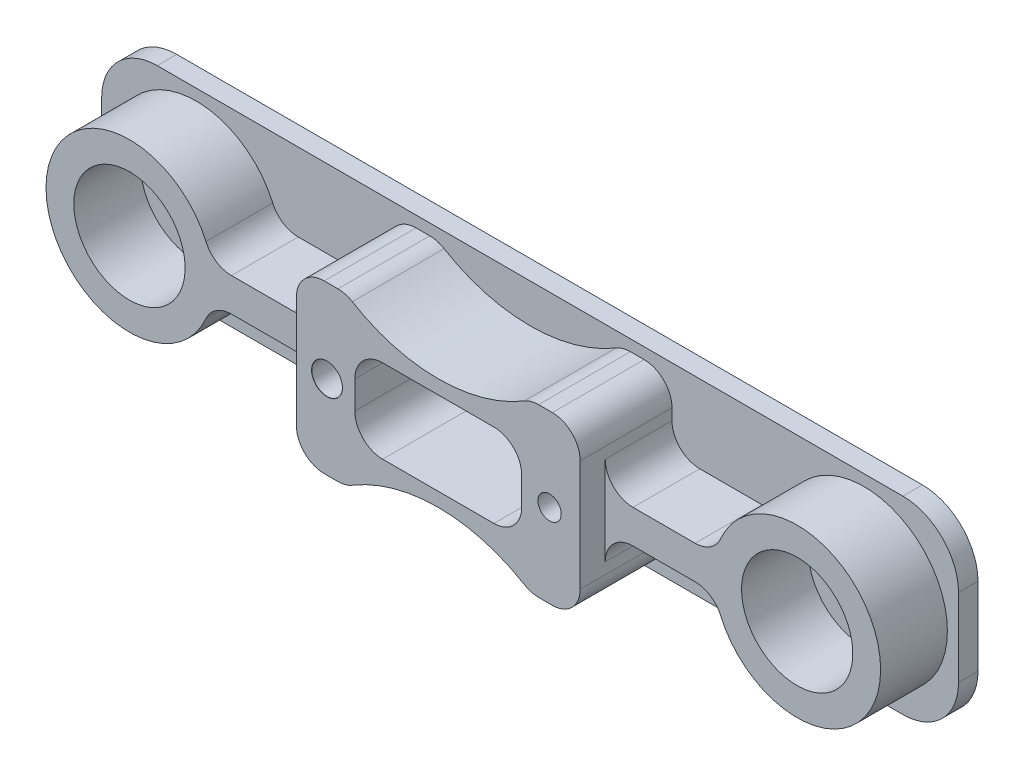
ISO-10303-21;
HEADER;
FILE_DESCRIPTION(('STEP AP214'),'2;1');
FILE_NAME('part.step','',(''),(''),'','','');
FILE_SCHEMA(('AUTOMOTIVE_DESIGN { 1 0 10303 214 1 1 1 1 }'));
ENDSEC;
DATA;
#1=APPLICATION_CONTEXT('core data for automotive mechanical design processes');
#2=APPLICATION_PROTOCOL_DEFINITION('international standard','automotive_design',2000,#1);
#3=PRODUCT_CONTEXT('',#1,'mechanical');
#4=PRODUCT('Part','Part','',(#3));
#5=PRODUCT_RELATED_PRODUCT_CATEGORY('part','',(#4));
#6=PRODUCT_DEFINITION_FORMATION('','',#4);
#7=PRODUCT_DEFINITION_CONTEXT('part definition',#1,'design');
#8=PRODUCT_DEFINITION('design','',#6,#7);
#9=PRODUCT_DEFINITION_SHAPE('','',#8);
#10=(LENGTH_UNIT() NAMED_UNIT(*) SI_UNIT(.MILLI.,.METRE.));
#11=(NAMED_UNIT(*) PLANE_ANGLE_UNIT() SI_UNIT($,.RADIAN.));
#12=(NAMED_UNIT(*) SI_UNIT($,.STERADIAN.) SOLID_ANGLE_UNIT());
#13=UNCERTAINTY_MEASURE_WITH_UNIT(LENGTH_MEASURE(1.E-05),#10,'distance_accuracy_value','');
#14=(GEOMETRIC_REPRESENTATION_CONTEXT(3) GLOBAL_UNCERTAINTY_ASSIGNED_CONTEXT((#13)) GLOBAL_UNIT_ASSIGNED_CONTEXT((#10,
#11,#12)) REPRESENTATION_CONTEXT('',''));
#15=CARTESIAN_POINT('',(0.,0.,0.));
#16=DIRECTION('',(0.,0.,1.));
#17=DIRECTION('',(1.,0.,0.));
#18=AXIS2_PLACEMENT_3D('',#15,#16,#17);
#19=CARTESIAN_POINT('',(67.0000000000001,-6.99999999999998,3.50000000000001));
#20=DIRECTION('',(0.,0.,0.999999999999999));
#21=DIRECTION('',(1.,0.,0.));
#22=AXIS2_PLACEMENT_3D('',#19,#20,#21);
#23=PLANE('',#22);
#24=DIRECTION('',(-1.,0.,0.));
#25=VECTOR('',#24,1.);
#26=CARTESIAN_POINT('',(67.0000000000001,17.,3.50000000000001));
#27=LINE('',#26,#25);
#28=CARTESIAN_POINT('',(67.0000000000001,17.,3.50000000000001));
#29=VERTEX_POINT('',#28);
#30=CARTESIAN_POINT('',(-67.,17.,3.5));
#31=VERTEX_POINT('',#30);
#32=EDGE_CURVE('E567',#29,#31,#27,.T.);
#33=ORIENTED_EDGE('',*,*,#32,.T.);
#34=CARTESIAN_POINT('',(-67.,7.,3.5));
#35=DIRECTION('',(0.,0.,0.999999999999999));
#36=DIRECTION('',(1.,0.,0.));
#37=AXIS2_PLACEMENT_3D('',#34,#35,#36);
#38=CIRCLE('',#37,9.99999999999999);
#39=CARTESIAN_POINT('',(-77.,6.99999999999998,3.50000000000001));
#40=VERTEX_POINT('',#39);
#41=EDGE_CURVE('E569',#31,#40,#38,.T.);
#42=ORIENTED_EDGE('',*,*,#41,.T.);
#43=DIRECTION('',(0.,-1.,0.));
#44=VECTOR('',#43,1.);
#45=CARTESIAN_POINT('',(-77.,-7.00000000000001,3.50000000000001));
#46=LINE('',#45,#44);
#47=CARTESIAN_POINT('',(-77.,-7.00000000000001,3.50000000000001));
#48=VERTEX_POINT('',#47);
#49=EDGE_CURVE('E571',#40,#48,#46,.T.);
#50=ORIENTED_EDGE('',*,*,#49,.T.);
#51=CARTESIAN_POINT('',(-67.,-7.00000000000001,3.5));
#52=DIRECTION('',(0.,0.,0.999999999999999));
#53=DIRECTION('',(-1.,0.,0.));
#54=AXIS2_PLACEMENT_3D('',#51,#52,#53);
#55=CIRCLE('',#54,9.99999999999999);
#56=CARTESIAN_POINT('',(-67.,-17.,3.5));
#57=VERTEX_POINT('',#56);
#58=EDGE_CURVE('E573',#48,#57,#55,.T.);
#59=ORIENTED_EDGE('',*,*,#58,.T.);
#60=DIRECTION('',(1.,0.,0.));
#61=VECTOR('',#60,1.);
#62=CARTESIAN_POINT('',(67.0000000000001,-17.,3.50000000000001));
#63=LINE('',#62,#61);
#64=CARTESIAN_POINT('',(67.0000000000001,-17.,3.50000000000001));
#65=VERTEX_POINT('',#64);
#66=EDGE_CURVE('E575',#57,#65,#63,.T.);
#67=ORIENTED_EDGE('',*,*,#66,.T.);
#68=CARTESIAN_POINT('',(67.0000000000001,-6.99999999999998,3.50000000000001));
#69=DIRECTION('',(0.,0.,0.999999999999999));
#70=DIRECTION('',(1.,0.,0.));
#71=AXIS2_PLACEMENT_3D('',#68,#69,#70);
#72=CIRCLE('',#71,10.);
#73=CARTESIAN_POINT('',(77.0000000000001,-6.99999999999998,3.5));
#74=VERTEX_POINT('',#73);
#75=EDGE_CURVE('E559',#65,#74,#72,.T.);
#76=ORIENTED_EDGE('',*,*,#75,.T.);
#77=DIRECTION('',(0.,1.,0.));
#78=VECTOR('',#77,1.);
#79=CARTESIAN_POINT('',(77.0000000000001,-6.99999999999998,3.5));
#80=LINE('',#79,#78);
#81=CARTESIAN_POINT('',(77.0000000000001,6.99999999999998,3.5));
#82=VERTEX_POINT('',#81);
#83=EDGE_CURVE('E562',#74,#82,#80,.T.);
#84=ORIENTED_EDGE('',*,*,#83,.T.);
#85=CARTESIAN_POINT('',(67.0000000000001,7.00000000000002,3.50000000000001));
#86=DIRECTION('',(0.,0.,0.999999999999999));
#87=DIRECTION('',(1.,0.,0.));
#88=AXIS2_PLACEMENT_3D('',#85,#86,#87);
#89=CIRCLE('',#88,10.);
#90=EDGE_CURVE('E565',#82,#29,#89,.T.);
#91=ORIENTED_EDGE('',*,*,#90,.T.);
#92=EDGE_LOOP('',(#33,#42,#50,#59,#67,#76,#84,#91));
#93=FACE_BOUND('',#92,.T.);
#94=CARTESIAN_POINT('',(60.,0.,3.50000000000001));
#95=DIRECTION('',(0.,0.,0.999999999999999));
#96=DIRECTION('',(-1.,0.,0.));
#97=AXIS2_PLACEMENT_3D('',#94,#95,#96);
#98=CIRCLE('',#97,15.);
#99=CARTESIAN_POINT('',(46.2522729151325,-6.00000000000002,3.5));
#100=VERTEX_POINT('',#99);
#101=CARTESIAN_POINT('',(46.2522729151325,5.99999999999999,3.5));
#102=VERTEX_POINT('',#101);
#103=EDGE_CURVE('E380',#100,#102,#98,.T.);
#104=ORIENTED_EDGE('',*,*,#103,.F.);
#105=CARTESIAN_POINT('',(41.6696972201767,-8.00000000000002,3.50000000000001));
#106=DIRECTION('',(0.,0.,0.999999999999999));
#107=DIRECTION('',(1.,0.,0.));
#108=AXIS2_PLACEMENT_3D('',#105,#106,#107);
#109=CIRCLE('',#108,5.);
#110=CARTESIAN_POINT('',(41.6696972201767,-3.00000000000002,3.50000000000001));
#111=VERTEX_POINT('',#110);
#112=EDGE_CURVE('E677',#100,#111,#109,.T.);
#113=ORIENTED_EDGE('',*,*,#112,.T.);
#114=DIRECTION('',(1.,0.,0.));
#115=VECTOR('',#114,1.);
#116=CARTESIAN_POINT('',(25.5,-3.00000000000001,3.50000000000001));
#117=LINE('',#116,#115);
#118=CARTESIAN_POINT('',(30.5,-3.00000000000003,3.5));
#119=VERTEX_POINT('',#118);
#120=EDGE_CURVE('E384',#119,#111,#117,.T.);
#121=ORIENTED_EDGE('',*,*,#120,.F.);
#122=CARTESIAN_POINT('',(30.5,-8.00000000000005,3.5));
#123=DIRECTION('',(0.,0.,0.999999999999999));
#124=DIRECTION('',(1.,0.,0.));
#125=AXIS2_PLACEMENT_3D('',#122,#123,#124);
#126=CIRCLE('',#125,5.);
#127=CARTESIAN_POINT('',(25.5,-8.00000000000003,3.50000000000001));
#128=VERTEX_POINT('',#127);
#129=EDGE_CURVE('E675',#119,#128,#126,.T.);
#130=ORIENTED_EDGE('',*,*,#129,.T.);
#131=DIRECTION('',(0.,1.,0.));
#132=VECTOR('',#131,1.);
#133=CARTESIAN_POINT('',(25.5,-9.99999999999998,3.50000000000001));
#134=LINE('',#133,#132);
#135=CARTESIAN_POINT('',(25.5,-9.99999999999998,3.50000000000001));
#136=VERTEX_POINT('',#135);
#137=EDGE_CURVE('E522',#136,#128,#134,.T.);
#138=ORIENTED_EDGE('',*,*,#137,.F.);
#139=CARTESIAN_POINT('',(20.5,-10.,3.50000000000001));
#140=DIRECTION('',(0.,0.,0.999999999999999));
#141=DIRECTION('',(1.,0.,0.));
#142=AXIS2_PLACEMENT_3D('',#139,#140,#141);
#143=CIRCLE('',#142,5.);
#144=CARTESIAN_POINT('',(20.5,-15.,3.50000000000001));
#145=VERTEX_POINT('',#144);
#146=EDGE_CURVE('E519',#145,#136,#143,.T.);
#147=ORIENTED_EDGE('',*,*,#146,.F.);
#148=DIRECTION('',(1.,0.,0.));
#149=VECTOR('',#148,1.);
#150=CARTESIAN_POINT('',(-20.5,-15.,3.50000000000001));
#151=LINE('',#150,#149);
#152=CARTESIAN_POINT('',(18.02775637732,-15.,3.5));
#153=VERTEX_POINT('',#152);
#154=EDGE_CURVE('E515',#153,#145,#151,.T.);
#155=ORIENTED_EDGE('',*,*,#154,.F.);
#156=CARTESIAN_POINT('',(18.02775637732,-10.,3.5));
#157=DIRECTION('',(0.,0.,0.999999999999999));
#158=DIRECTION('',(1.,0.,0.));
#159=AXIS2_PLACEMENT_3D('',#156,#157,#158);
#160=CIRCLE('',#159,5.);
#161=CARTESIAN_POINT('',(15.4523626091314,-14.2857142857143,3.5));
#162=VERTEX_POINT('',#161);
#163=EDGE_CURVE('E650',#153,#162,#160,.F.);
#164=ORIENTED_EDGE('',*,*,#163,.T.);
#165=CARTESIAN_POINT('',(0.,-40.,3.50000000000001));
#166=DIRECTION('',(0.,0.,0.999999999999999));
#167=DIRECTION('',(1.,0.,0.));
#168=AXIS2_PLACEMENT_3D('',#165,#166,#167);
#169=CIRCLE('',#168,30.);
#170=CARTESIAN_POINT('',(-15.4523626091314,-14.2857142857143,3.50000000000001));
#171=VERTEX_POINT('',#170);
#172=EDGE_CURVE('E429',#171,#162,#169,.F.);
#173=ORIENTED_EDGE('',*,*,#172,.F.);
#174=CARTESIAN_POINT('',(-18.02775637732,-10.,3.50000000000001));
#175=DIRECTION('',(0.,0.,0.999999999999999));
#176=DIRECTION('',(1.,0.,0.));
#177=AXIS2_PLACEMENT_3D('',#174,#175,#176);
#178=CIRCLE('',#177,5.);
#179=CARTESIAN_POINT('',(-18.0277563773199,-15.,3.50000000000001));
#180=VERTEX_POINT('',#179);
#181=EDGE_CURVE('E648',#171,#180,#178,.F.);
#182=ORIENTED_EDGE('',*,*,#181,.T.);
#183=CARTESIAN_POINT('',(-20.5,-15.,3.50000000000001));
#184=VERTEX_POINT('',#183);
#185=EDGE_CURVE('E516',#184,#180,#151,.T.);
#186=ORIENTED_EDGE('',*,*,#185,.F.);
#187=CARTESIAN_POINT('',(-20.5,-10.,3.50000000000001));
#188=DIRECTION('',(0.,0.,0.999999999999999));
#189=DIRECTION('',(-1.,0.,0.));
#190=AXIS2_PLACEMENT_3D('',#187,#188,#189);
#191=CIRCLE('',#190,5.);
#192=CARTESIAN_POINT('',(-25.5,-9.99999999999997,3.5));
#193=VERTEX_POINT('',#192);
#194=EDGE_CURVE('E489',#193,#184,#191,.T.);
#195=ORIENTED_EDGE('',*,*,#194,.F.);
#196=DIRECTION('',(0.,-1.,0.));
#197=VECTOR('',#196,1.);
#198=CARTESIAN_POINT('',(-25.5,-9.99999999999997,3.5));
#199=LINE('',#198,#197);
#200=CARTESIAN_POINT('',(-25.5,-8.,3.5));
#201=VERTEX_POINT('',#200);
#202=EDGE_CURVE('E534',#201,#193,#199,.T.);
#203=ORIENTED_EDGE('',*,*,#202,.F.);
#204=CARTESIAN_POINT('',(-30.5,-8.,3.5));
#205=DIRECTION('',(0.,0.,0.999999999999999));
#206=DIRECTION('',(1.,0.,0.));
#207=AXIS2_PLACEMENT_3D('',#204,#205,#206);
#208=CIRCLE('',#207,5.);
#209=CARTESIAN_POINT('',(-30.5,-2.99999999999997,3.5));
#210=VERTEX_POINT('',#209);
#211=EDGE_CURVE('E671',#201,#210,#208,.T.);
#212=ORIENTED_EDGE('',*,*,#211,.T.);
#213=DIRECTION('',(1.,0.,0.));
#214=VECTOR('',#213,1.);
#215=CARTESIAN_POINT('',(-25.5,-3.,3.5));
#216=LINE('',#215,#214);
#217=CARTESIAN_POINT('',(-41.6696972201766,-3.,3.5));
#218=VERTEX_POINT('',#217);
#219=EDGE_CURVE('E404',#218,#210,#216,.T.);
#220=ORIENTED_EDGE('',*,*,#219,.F.);
#221=CARTESIAN_POINT('',(-41.6696972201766,-8.,3.5));
#222=DIRECTION('',(0.,0.,0.999999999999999));
#223=DIRECTION('',(1.,0.,0.));
#224=AXIS2_PLACEMENT_3D('',#221,#222,#223);
#225=CIRCLE('',#224,5.);
#226=CARTESIAN_POINT('',(-46.2522729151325,-5.99999999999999,3.5));
#227=VERTEX_POINT('',#226);
#228=EDGE_CURVE('E673',#218,#227,#225,.T.);
#229=ORIENTED_EDGE('',*,*,#228,.T.);
#230=CARTESIAN_POINT('',(-60.,0.,3.50000000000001));
#231=DIRECTION('',(0.,0.,0.999999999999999));
#232=DIRECTION('',(1.,0.,0.));
#233=AXIS2_PLACEMENT_3D('',#230,#231,#232);
#234=CIRCLE('',#233,15.);
#235=CARTESIAN_POINT('',(-46.2522729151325,6.00000000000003,3.5));
#236=VERTEX_POINT('',#235);
#237=EDGE_CURVE('E416',#236,#227,#234,.T.);
#238=ORIENTED_EDGE('',*,*,#237,.F.);
#239=CARTESIAN_POINT('',(-41.6696972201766,8.,3.5));
#240=DIRECTION('',(0.,0.,0.999999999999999));
#241=DIRECTION('',(1.,0.,0.));
#242=AXIS2_PLACEMENT_3D('',#239,#240,#241);
#243=CIRCLE('',#242,5.);
#244=CARTESIAN_POINT('',(-41.6696972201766,3.00000000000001,3.5));
#245=VERTEX_POINT('',#244);
#246=EDGE_CURVE('E663',#236,#245,#243,.T.);
#247=ORIENTED_EDGE('',*,*,#246,.T.);
#248=DIRECTION('',(-1.,0.,0.));
#249=VECTOR('',#248,1.);
#250=CARTESIAN_POINT('',(-25.5,3.00000000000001,3.5));
#251=LINE('',#250,#249);
#252=CARTESIAN_POINT('',(-30.5,2.99999999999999,3.5));
#253=VERTEX_POINT('',#252);
#254=EDGE_CURVE('E400',#253,#245,#251,.T.);
#255=ORIENTED_EDGE('',*,*,#254,.F.);
#256=CARTESIAN_POINT('',(-30.5,7.99999999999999,3.5));
#257=DIRECTION('',(0.,0.,0.999999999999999));
#258=DIRECTION('',(1.,0.,0.));
#259=AXIS2_PLACEMENT_3D('',#256,#257,#258);
#260=CIRCLE('',#259,5.);
#261=CARTESIAN_POINT('',(-25.5,8.00000000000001,3.5));
#262=VERTEX_POINT('',#261);
#263=EDGE_CURVE('E669',#253,#262,#260,.T.);
#264=ORIENTED_EDGE('',*,*,#263,.T.);
#265=CARTESIAN_POINT('',(-25.5,9.99999999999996,3.5));
#266=VERTEX_POINT('',#265);
#267=EDGE_CURVE('E494',#266,#262,#199,.T.);
#268=ORIENTED_EDGE('',*,*,#267,.F.);
#269=CARTESIAN_POINT('',(-20.5,9.99999999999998,3.50000000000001));
#270=DIRECTION('',(0.,0.,0.999999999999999));
#271=DIRECTION('',(-1.,0.,0.));
#272=AXIS2_PLACEMENT_3D('',#269,#270,#271);
#273=CIRCLE('',#272,5.);
#274=CARTESIAN_POINT('',(-20.5,15.,3.50000000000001));
#275=VERTEX_POINT('',#274);
#276=EDGE_CURVE('E531',#275,#266,#273,.T.);
#277=ORIENTED_EDGE('',*,*,#276,.F.);
#278=DIRECTION('',(-1.,0.,0.));
#279=VECTOR('',#278,1.);
#280=CARTESIAN_POINT('',(-20.5,15.,3.50000000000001));
#281=LINE('',#280,#279);
#282=CARTESIAN_POINT('',(-18.0277563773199,15.,3.50000000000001));
#283=VERTEX_POINT('',#282);
#284=EDGE_CURVE('E527',#283,#275,#281,.T.);
#285=ORIENTED_EDGE('',*,*,#284,.F.);
#286=CARTESIAN_POINT('',(-18.0277563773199,9.99999999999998,3.50000000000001));
#287=DIRECTION('',(0.,0.,0.999999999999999));
#288=DIRECTION('',(1.,0.,0.));
#289=AXIS2_PLACEMENT_3D('',#286,#287,#288);
#290=CIRCLE('',#289,5.);
#291=CARTESIAN_POINT('',(-15.4523626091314,14.2857142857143,3.50000000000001));
#292=VERTEX_POINT('',#291);
#293=EDGE_CURVE('E646',#283,#292,#290,.F.);
#294=ORIENTED_EDGE('',*,*,#293,.T.);
#295=CARTESIAN_POINT('',(0.,40.,3.50000000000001));
#296=DIRECTION('',(0.,0.,0.999999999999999));
#297=DIRECTION('',(1.,0.,0.));
#298=AXIS2_PLACEMENT_3D('',#295,#296,#297);
#299=CIRCLE('',#298,30.);
#300=CARTESIAN_POINT('',(15.4523626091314,14.2857142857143,3.5));
#301=VERTEX_POINT('',#300);
#302=EDGE_CURVE('E423',#301,#292,#299,.F.);
#303=ORIENTED_EDGE('',*,*,#302,.F.);
#304=CARTESIAN_POINT('',(18.02775637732,10.,3.5));
#305=DIRECTION('',(0.,0.,0.999999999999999));
#306=DIRECTION('',(1.,0.,0.));
#307=AXIS2_PLACEMENT_3D('',#304,#305,#306);
#308=CIRCLE('',#307,5.);
#309=CARTESIAN_POINT('',(18.02775637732,15.,3.5));
#310=VERTEX_POINT('',#309);
#311=EDGE_CURVE('E644',#301,#310,#308,.F.);
#312=ORIENTED_EDGE('',*,*,#311,.T.);
#313=CARTESIAN_POINT('',(20.5,15.,3.50000000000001));
#314=VERTEX_POINT('',#313);
#315=EDGE_CURVE('E528',#314,#310,#281,.T.);
#316=ORIENTED_EDGE('',*,*,#315,.F.);
#317=CARTESIAN_POINT('',(20.5,10.,3.50000000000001));
#318=DIRECTION('',(0.,0.,0.999999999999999));
#319=DIRECTION('',(-1.,0.,0.));
#320=AXIS2_PLACEMENT_3D('',#317,#318,#319);
#321=CIRCLE('',#320,5.);
#322=CARTESIAN_POINT('',(25.5,9.99999999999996,3.50000000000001));
#323=VERTEX_POINT('',#322);
#324=EDGE_CURVE('E525',#323,#314,#321,.T.);
#325=ORIENTED_EDGE('',*,*,#324,.F.);
#326=CARTESIAN_POINT('',(25.5,7.99999999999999,3.50000000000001));
#327=VERTEX_POINT('',#326);
#328=EDGE_CURVE('E521',#327,#323,#134,.T.);
#329=ORIENTED_EDGE('',*,*,#328,.F.);
#330=CARTESIAN_POINT('',(30.5,7.99999999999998,3.5));
#331=DIRECTION('',(0.,0.,0.999999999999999));
#332=DIRECTION('',(1.,0.,0.));
#333=AXIS2_PLACEMENT_3D('',#330,#331,#332);
#334=CIRCLE('',#333,5.);
#335=CARTESIAN_POINT('',(30.5,2.99999999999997,3.5));
#336=VERTEX_POINT('',#335);
#337=EDGE_CURVE('E665',#327,#336,#334,.T.);
#338=ORIENTED_EDGE('',*,*,#337,.T.);
#339=DIRECTION('',(-1.,0.,0.));
#340=VECTOR('',#339,1.);
#341=CARTESIAN_POINT('',(25.5,2.99999999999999,3.50000000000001));
#342=LINE('',#341,#340);
#343=CARTESIAN_POINT('',(41.6696972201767,2.99999999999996,3.50000000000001));
#344=VERTEX_POINT('',#343);
#345=EDGE_CURVE('E394',#344,#336,#342,.T.);
#346=ORIENTED_EDGE('',*,*,#345,.F.);
#347=CARTESIAN_POINT('',(41.6696972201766,7.99999999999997,3.50000000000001));
#348=DIRECTION('',(0.,0.,0.999999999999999));
#349=DIRECTION('',(1.,0.,0.));
#350=AXIS2_PLACEMENT_3D('',#347,#348,#349);
#351=CIRCLE('',#350,5.);
#352=EDGE_CURVE('E667',#344,#102,#351,.T.);
#353=ORIENTED_EDGE('',*,*,#352,.T.);
#354=EDGE_LOOP('',(#104,#113,#121,#130,#138,#147,#155,#164,#173,#182,#186,#195,#203,#212,#220,
#229,#238,#247,#255,#264,#268,#277,#285,#294,#303,#312,#316,#325,#329,#338,#346,#353));
#355=FACE_BOUND('',#354,.T.);
#356=ADVANCED_FACE('F40',(#93,#355),#23,.T.);
#357=CARTESIAN_POINT('',(25.5,-9.99999999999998,20.));
#358=DIRECTION('',(-1.,0.,0.));
#359=DIRECTION('',(0.,0.,0.999999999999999));
#360=AXIS2_PLACEMENT_3D('',#357,#358,#359);
#361=PLANE('',#360);
#362=ORIENTED_EDGE('',*,*,#137,.T.);
#363=DIRECTION('',(0.,0.,-0.999999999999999));
#364=VECTOR('',#363,1.);
#365=CARTESIAN_POINT('',(25.5,-8.00000000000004,15.5));
#366=LINE('',#365,#364);
#367=CARTESIAN_POINT('',(25.5,-8.,15.5));
#368=VERTEX_POINT('',#367);
#369=EDGE_CURVE('E687',#128,#368,#366,.F.);
#370=ORIENTED_EDGE('',*,*,#369,.T.);
#371=DIRECTION('',(0.,-1.,0.));
#372=VECTOR('',#371,1.);
#373=CARTESIAN_POINT('',(25.5,2.99999999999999,15.5));
#374=LINE('',#373,#372);
#375=CARTESIAN_POINT('',(25.5,7.99999999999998,15.5));
#376=VERTEX_POINT('',#375);
#377=EDGE_CURVE('E386',#376,#368,#374,.T.);
#378=ORIENTED_EDGE('',*,*,#377,.F.);
#379=DIRECTION('',(0.,0.,-0.999999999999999));
#380=VECTOR('',#379,1.);
#381=CARTESIAN_POINT('',(25.5,7.99999999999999,3.50000000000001));
#382=LINE('',#381,#380);
#383=EDGE_CURVE('E684',#376,#327,#382,.T.);
#384=ORIENTED_EDGE('',*,*,#383,.T.);
#385=ORIENTED_EDGE('',*,*,#328,.T.);
#386=DIRECTION('',(0.,0.,-0.999999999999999));
#387=VECTOR('',#386,1.);
#388=CARTESIAN_POINT('',(25.5,9.99999999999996,20.));
#389=LINE('',#388,#387);
#390=CARTESIAN_POINT('',(25.5,9.99999999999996,20.));
#391=VERTEX_POINT('',#390);
#392=EDGE_CURVE('E547',#391,#323,#389,.T.);
#393=ORIENTED_EDGE('',*,*,#392,.F.);
#394=DIRECTION('',(0.,1.,0.));
#395=VECTOR('',#394,1.);
#396=CARTESIAN_POINT('',(25.5,-9.99999999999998,20.));
#397=LINE('',#396,#395);
#398=CARTESIAN_POINT('',(25.5,-9.99999999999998,20.));
#399=VERTEX_POINT('',#398);
#400=EDGE_CURVE('E500',#399,#391,#397,.T.);
#401=ORIENTED_EDGE('',*,*,#400,.F.);
#402=DIRECTION('',(0.,0.,-0.999999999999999));
#403=VECTOR('',#402,1.);
#404=CARTESIAN_POINT('',(25.5,-9.99999999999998,20.));
#405=LINE('',#404,#403);
#406=EDGE_CURVE('E550',#399,#136,#405,.T.);
#407=ORIENTED_EDGE('',*,*,#406,.T.);
#408=EDGE_LOOP('',(#362,#370,#378,#384,#385,#393,#401,#407));
#409=FACE_BOUND('',#408,.T.);
#410=ADVANCED_FACE('F735',(#409),#361,.F.);
#411=CARTESIAN_POINT('',(-25.5,-9.99999999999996,20.));
#412=DIRECTION('',(1.,0.,0.));
#413=DIRECTION('',(0.,0.,-0.999999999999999));
#414=AXIS2_PLACEMENT_3D('',#411,#412,#413);
#415=PLANE('',#414);
#416=DIRECTION('',(0.,1.,0.));
#417=VECTOR('',#416,1.);
#418=CARTESIAN_POINT('',(-25.5,3.00000000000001,15.5));
#419=LINE('',#418,#417);
#420=CARTESIAN_POINT('',(-25.5,-8.,15.5));
#421=VERTEX_POINT('',#420);
#422=CARTESIAN_POINT('',(-25.5,8.00000000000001,15.5));
#423=VERTEX_POINT('',#422);
#424=EDGE_CURVE('E401',#421,#423,#419,.T.);
#425=ORIENTED_EDGE('',*,*,#424,.F.);
#426=DIRECTION('',(0.,0.,-0.999999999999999));
#427=VECTOR('',#426,1.);
#428=CARTESIAN_POINT('',(-25.5,-8.,3.5));
#429=LINE('',#428,#427);
#430=EDGE_CURVE('E703',#421,#201,#429,.T.);
#431=ORIENTED_EDGE('',*,*,#430,.T.);
#432=ORIENTED_EDGE('',*,*,#202,.T.);
#433=DIRECTION('',(0.,0.,-0.999999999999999));
#434=VECTOR('',#433,1.);
#435=CARTESIAN_POINT('',(-25.5,-9.99999999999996,20.));
#436=LINE('',#435,#434);
#437=CARTESIAN_POINT('',(-25.5,-9.99999999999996,20.));
#438=VERTEX_POINT('',#437);
#439=EDGE_CURVE('E512',#438,#193,#436,.T.);
#440=ORIENTED_EDGE('',*,*,#439,.F.);
#441=DIRECTION('',(0.,-1.,0.));
#442=VECTOR('',#441,1.);
#443=CARTESIAN_POINT('',(-25.5,-9.99999999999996,20.));
#444=LINE('',#443,#442);
#445=CARTESIAN_POINT('',(-25.5,9.99999999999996,20.));
#446=VERTEX_POINT('',#445);
#447=EDGE_CURVE('E510',#446,#438,#444,.T.);
#448=ORIENTED_EDGE('',*,*,#447,.F.);
#449=DIRECTION('',(0.,0.,-0.999999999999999));
#450=VECTOR('',#449,1.);
#451=CARTESIAN_POINT('',(-25.5,9.99999999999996,20.));
#452=LINE('',#451,#450);
#453=EDGE_CURVE('E539',#446,#266,#452,.T.);
#454=ORIENTED_EDGE('',*,*,#453,.T.);
#455=ORIENTED_EDGE('',*,*,#267,.T.);
#456=DIRECTION('',(0.,0.,-0.999999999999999));
#457=VECTOR('',#456,1.);
#458=CARTESIAN_POINT('',(-25.5,8.00000000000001,15.5));
#459=LINE('',#458,#457);
#460=EDGE_CURVE('E700',#262,#423,#459,.F.);
#461=ORIENTED_EDGE('',*,*,#460,.T.);
#462=EDGE_LOOP('',(#425,#431,#432,#440,#448,#454,#455,#461));
#463=FACE_BOUND('',#462,.T.);
#464=ADVANCED_FACE('F800',(#463),#415,.F.);
#465=CARTESIAN_POINT('',(-20.5,15.,20.));
#466=DIRECTION('',(0.,-1.,0.));
#467=DIRECTION('',(0.,0.,-0.999999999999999));
#468=AXIS2_PLACEMENT_3D('',#465,#466,#467);
#469=PLANE('',#468);
#470=ORIENTED_EDGE('',*,*,#315,.T.);
#471=DIRECTION('',(0.,0.,0.999999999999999));
#472=VECTOR('',#471,1.);
#473=CARTESIAN_POINT('',(18.02775637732,15.,20.));
#474=LINE('',#473,#472);
#475=CARTESIAN_POINT('',(18.02775637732,15.,20.));
#476=VERTEX_POINT('',#475);
#477=EDGE_CURVE('E616',#310,#476,#474,.T.);
#478=ORIENTED_EDGE('',*,*,#477,.T.);
#479=DIRECTION('',(-1.,0.,0.));
#480=VECTOR('',#479,1.);
#481=CARTESIAN_POINT('',(-20.5,15.,20.));
#482=LINE('',#481,#480);
#483=CARTESIAN_POINT('',(20.5,15.,20.));
#484=VERTEX_POINT('',#483);
#485=EDGE_CURVE('E505',#484,#476,#482,.T.);
#486=ORIENTED_EDGE('',*,*,#485,.F.);
#487=DIRECTION('',(0.,0.,-0.999999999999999));
#488=VECTOR('',#487,1.);
#489=CARTESIAN_POINT('',(20.5,15.,20.));
#490=LINE('',#489,#488);
#491=EDGE_CURVE('E544',#484,#314,#490,.T.);
#492=ORIENTED_EDGE('',*,*,#491,.T.);
#493=EDGE_LOOP('',(#470,#478,#486,#492));
#494=FACE_BOUND('',#493,.T.);
#495=ADVANCED_FACE('F748',(#494),#469,.F.);
#496=CARTESIAN_POINT('',(-20.5,-15.,20.));
#497=DIRECTION('',(0.,1.,0.));
#498=DIRECTION('',(0.,0.,0.999999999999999));
#499=AXIS2_PLACEMENT_3D('',#496,#497,#498);
#500=PLANE('',#499);
#501=ORIENTED_EDGE('',*,*,#185,.T.);
#502=DIRECTION('',(0.,0.,0.999999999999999));
#503=VECTOR('',#502,1.);
#504=CARTESIAN_POINT('',(-18.0277563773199,-15.,20.));
#505=LINE('',#504,#503);
#506=CARTESIAN_POINT('',(-18.0277563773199,-15.,20.));
#507=VERTEX_POINT('',#506);
#508=EDGE_CURVE('E634',#180,#507,#505,.T.);
#509=ORIENTED_EDGE('',*,*,#508,.T.);
#510=DIRECTION('',(1.,0.,0.));
#511=VECTOR('',#510,1.);
#512=CARTESIAN_POINT('',(-20.5,-15.,20.));
#513=LINE('',#512,#511);
#514=CARTESIAN_POINT('',(-20.5,-15.,20.));
#515=VERTEX_POINT('',#514);
#516=EDGE_CURVE('E495',#515,#507,#513,.T.);
#517=ORIENTED_EDGE('',*,*,#516,.F.);
#518=DIRECTION('',(0.,0.,-0.999999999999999));
#519=VECTOR('',#518,1.);
#520=CARTESIAN_POINT('',(-20.5,-15.,20.));
#521=LINE('',#520,#519);
#522=EDGE_CURVE('E556',#515,#184,#521,.T.);
#523=ORIENTED_EDGE('',*,*,#522,.T.);
#524=EDGE_LOOP('',(#501,#509,#517,#523));
#525=FACE_BOUND('',#524,.T.);
#526=ADVANCED_FACE('F908',(#525),#500,.F.);
#527=CARTESIAN_POINT('',(67.0000000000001,-6.99999999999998,3.50000000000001));
#528=DIRECTION('',(0.,0.,-0.999999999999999));
#529=DIRECTION('',(-1.,0.,0.));
#530=AXIS2_PLACEMENT_3D('',#527,#528,#529);
#531=CYLINDRICAL_SURFACE('',#530,10.);
#532=CARTESIAN_POINT('',(67.,-7.,0.));
#533=DIRECTION('',(0.,0.,0.999999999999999));
#534=DIRECTION('',(1.,0.,0.));
#535=AXIS2_PLACEMENT_3D('',#532,#533,#534);
#536=CIRCLE('',#535,10.);
#537=CARTESIAN_POINT('',(67.0000000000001,-17.,0.));
#538=VERTEX_POINT('',#537);
#539=CARTESIAN_POINT('',(77.0000000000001,-6.99999999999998,0.));
#540=VERTEX_POINT('',#539);
#541=EDGE_CURVE('E558',#538,#540,#536,.T.);
#542=ORIENTED_EDGE('',*,*,#541,.T.);
#543=DIRECTION('',(0.,0.,-0.999999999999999));
#544=VECTOR('',#543,1.);
#545=CARTESIAN_POINT('',(77.0000000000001,-6.99999999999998,3.5));
#546=LINE('',#545,#544);
#547=EDGE_CURVE('E613',#74,#540,#546,.T.);
#548=ORIENTED_EDGE('',*,*,#547,.F.);
#549=ORIENTED_EDGE('',*,*,#75,.F.);
#550=DIRECTION('',(0.,0.,-0.999999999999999));
#551=VECTOR('',#550,1.);
#552=CARTESIAN_POINT('',(67.0000000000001,-17.,3.50000000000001));
#553=LINE('',#552,#551);
#554=EDGE_CURVE('E577',#65,#538,#553,.T.);
#555=ORIENTED_EDGE('',*,*,#554,.T.);
#556=EDGE_LOOP('',(#542,#548,#549,#555));
#557=FACE_BOUND('',#556,.T.);
#558=ADVANCED_FACE('F1012',(#557),#531,.T.);
#559=CARTESIAN_POINT('',(77.0000000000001,-6.99999999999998,3.5));
#560=DIRECTION('',(-1.,0.,0.));
#561=DIRECTION('',(0.,0.,0.999999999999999));
#562=AXIS2_PLACEMENT_3D('',#559,#560,#561);
#563=PLANE('',#562);
#564=DIRECTION('',(0.,1.,0.));
#565=VECTOR('',#564,1.);
#566=CARTESIAN_POINT('',(77.0000000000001,-6.99999999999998,0.));
#567=LINE('',#566,#565);
#568=CARTESIAN_POINT('',(77.0000000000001,6.99999999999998,0.));
#569=VERTEX_POINT('',#568);
#570=EDGE_CURVE('E580',#540,#569,#567,.T.);
#571=ORIENTED_EDGE('',*,*,#570,.T.);
#572=DIRECTION('',(0.,0.,-0.999999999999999));
#573=VECTOR('',#572,1.);
#574=CARTESIAN_POINT('',(77.0000000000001,6.99999999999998,3.5));
#575=LINE('',#574,#573);
#576=EDGE_CURVE('E610',#82,#569,#575,.T.);
#577=ORIENTED_EDGE('',*,*,#576,.F.);
#578=ORIENTED_EDGE('',*,*,#83,.F.);
#579=ORIENTED_EDGE('',*,*,#547,.T.);
#580=EDGE_LOOP('',(#571,#577,#578,#579));
#581=FACE_BOUND('',#580,.T.);
#582=ADVANCED_FACE('F1015',(#581),#563,.F.);
#583=CARTESIAN_POINT('',(67.0000000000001,7.00000000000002,3.50000000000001));
#584=DIRECTION('',(0.,0.,-0.999999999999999));
#585=DIRECTION('',(-1.,0.,0.));
#586=AXIS2_PLACEMENT_3D('',#583,#584,#585);
#587=CYLINDRICAL_SURFACE('',#586,10.);
#588=CARTESIAN_POINT('',(67.0000000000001,7.00000000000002,0.));
#589=DIRECTION('',(0.,0.,0.999999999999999));
#590=DIRECTION('',(1.,0.,0.));
#591=AXIS2_PLACEMENT_3D('',#588,#589,#590);
#592=CIRCLE('',#591,10.);
#593=CARTESIAN_POINT('',(67.0000000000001,17.,0.));
#594=VERTEX_POINT('',#593);
#595=EDGE_CURVE('E582',#569,#594,#592,.T.);
#596=ORIENTED_EDGE('',*,*,#595,.T.);
#597=DIRECTION('',(0.,0.,-0.999999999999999));
#598=VECTOR('',#597,1.);
#599=CARTESIAN_POINT('',(67.0000000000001,17.,3.50000000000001));
#600=LINE('',#599,#598);
#601=EDGE_CURVE('E607',#29,#594,#600,.T.);
#602=ORIENTED_EDGE('',*,*,#601,.F.);
#603=ORIENTED_EDGE('',*,*,#90,.F.);
#604=ORIENTED_EDGE('',*,*,#576,.T.);
#605=EDGE_LOOP('',(#596,#602,#603,#604));
#606=FACE_BOUND('',#605,.T.);
#607=ADVANCED_FACE('F1019',(#606),#587,.T.);
#608=CARTESIAN_POINT('',(67.0000000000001,17.,3.50000000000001));
#609=DIRECTION('',(0.,-1.,0.));
#610=DIRECTION('',(1.,0.,0.));
#611=AXIS2_PLACEMENT_3D('',#608,#609,#610);
#612=PLANE('',#611);
#613=DIRECTION('',(-1.,0.,0.));
#614=VECTOR('',#613,1.);
#615=CARTESIAN_POINT('',(67.0000000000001,17.,0.));
#616=LINE('',#615,#614);
#617=CARTESIAN_POINT('',(-67.,17.,0.));
#618=VERTEX_POINT('',#617);
#619=EDGE_CURVE('E584',#594,#618,#616,.T.);
#620=ORIENTED_EDGE('',*,*,#619,.T.);
#621=DIRECTION('',(0.,0.,-0.999999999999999));
#622=VECTOR('',#621,1.);
#623=CARTESIAN_POINT('',(-67.,17.,3.5));
#624=LINE('',#623,#622);
#625=EDGE_CURVE('E604',#31,#618,#624,.T.);
#626=ORIENTED_EDGE('',*,*,#625,.F.);
#627=ORIENTED_EDGE('',*,*,#32,.F.);
#628=ORIENTED_EDGE('',*,*,#601,.T.);
#629=EDGE_LOOP('',(#620,#626,#627,#628));
#630=FACE_BOUND('',#629,.T.);
#631=ADVANCED_FACE('F1023',(#630),#612,.F.);
#632=CARTESIAN_POINT('',(-67.,7.,3.5));
#633=DIRECTION('',(0.,0.,-0.999999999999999));
#634=DIRECTION('',(-1.,0.,0.));
#635=AXIS2_PLACEMENT_3D('',#632,#633,#634);
#636=CYLINDRICAL_SURFACE('',#635,9.99999999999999);
#637=CARTESIAN_POINT('',(-67.,7.,0.));
#638=DIRECTION('',(0.,0.,0.999999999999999));
#639=DIRECTION('',(1.,0.,0.));
#640=AXIS2_PLACEMENT_3D('',#637,#638,#639);
#641=CIRCLE('',#640,9.99999999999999);
#642=CARTESIAN_POINT('',(-77.,6.99999999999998,0.));
#643=VERTEX_POINT('',#642);
#644=EDGE_CURVE('E586',#618,#643,#641,.T.);
#645=ORIENTED_EDGE('',*,*,#644,.T.);
#646=DIRECTION('',(0.,0.,-0.999999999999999));
#647=VECTOR('',#646,1.);
#648=CARTESIAN_POINT('',(-77.,6.99999999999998,3.50000000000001));
#649=LINE('',#648,#647);
#650=EDGE_CURVE('E601',#40,#643,#649,.T.);
#651=ORIENTED_EDGE('',*,*,#650,.F.);
#652=ORIENTED_EDGE('',*,*,#41,.F.);
#653=ORIENTED_EDGE('',*,*,#625,.T.);
#654=EDGE_LOOP('',(#645,#651,#652,#653));
#655=FACE_BOUND('',#654,.T.);
#656=ADVANCED_FACE('F1027',(#655),#636,.T.);
#657=CARTESIAN_POINT('',(-77.,-7.00000000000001,3.50000000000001));
#658=DIRECTION('',(1.,0.,0.));
#659=DIRECTION('',(0.,1.,0.));
#660=AXIS2_PLACEMENT_3D('',#657,#658,#659);
#661=PLANE('',#660);
#662=DIRECTION('',(0.,-1.,0.));
#663=VECTOR('',#662,1.);
#664=CARTESIAN_POINT('',(-77.,-7.00000000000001,0.));
#665=LINE('',#664,#663);
#666=CARTESIAN_POINT('',(-77.,-7.00000000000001,0.));
#667=VERTEX_POINT('',#666);
#668=EDGE_CURVE('E588',#643,#667,#665,.T.);
#669=ORIENTED_EDGE('',*,*,#668,.T.);
#670=DIRECTION('',(0.,0.,-0.999999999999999));
#671=VECTOR('',#670,1.);
#672=CARTESIAN_POINT('',(-77.,-7.00000000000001,3.50000000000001));
#673=LINE('',#672,#671);
#674=EDGE_CURVE('E598',#48,#667,#673,.T.);
#675=ORIENTED_EDGE('',*,*,#674,.F.);
#676=ORIENTED_EDGE('',*,*,#49,.F.);
#677=ORIENTED_EDGE('',*,*,#650,.T.);
#678=EDGE_LOOP('',(#669,#675,#676,#677));
#679=FACE_BOUND('',#678,.T.);
#680=ADVANCED_FACE('F1031',(#679),#661,.F.);
#681=CARTESIAN_POINT('',(-67.,-7.00000000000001,3.5));
#682=DIRECTION('',(0.,0.,-0.999999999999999));
#683=DIRECTION('',(-1.,0.,0.));
#684=AXIS2_PLACEMENT_3D('',#681,#682,#683);
#685=CYLINDRICAL_SURFACE('',#684,9.99999999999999);
#686=CARTESIAN_POINT('',(-67.,-7.00000000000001,0.));
#687=DIRECTION('',(0.,0.,0.999999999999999));
#688=DIRECTION('',(-1.,0.,0.));
#689=AXIS2_PLACEMENT_3D('',#686,#687,#688);
#690=CIRCLE('',#689,9.99999999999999);
#691=CARTESIAN_POINT('',(-67.,-17.,0.));
#692=VERTEX_POINT('',#691);
#693=EDGE_CURVE('E590',#667,#692,#690,.T.);
#694=ORIENTED_EDGE('',*,*,#693,.T.);
#695=DIRECTION('',(0.,0.,-0.999999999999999));
#696=VECTOR('',#695,1.);
#697=CARTESIAN_POINT('',(-67.,-17.,3.5));
#698=LINE('',#697,#696);
#699=EDGE_CURVE('E595',#57,#692,#698,.T.);
#700=ORIENTED_EDGE('',*,*,#699,.F.);
#701=ORIENTED_EDGE('',*,*,#58,.F.);
#702=ORIENTED_EDGE('',*,*,#674,.T.);
#703=EDGE_LOOP('',(#694,#700,#701,#702));
#704=FACE_BOUND('',#703,.T.);
#705=ADVANCED_FACE('F1035',(#704),#685,.T.);
#706=CARTESIAN_POINT('',(67.0000000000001,-17.,3.50000000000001));
#707=DIRECTION('',(0.,1.,0.));
#708=DIRECTION('',(-1.,0.,0.));
#709=AXIS2_PLACEMENT_3D('',#706,#707,#708);
#710=PLANE('',#709);
#711=DIRECTION('',(1.,0.,0.));
#712=VECTOR('',#711,1.);
#713=CARTESIAN_POINT('',(67.0000000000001,-17.,0.));
#714=LINE('',#713,#712);
#715=EDGE_CURVE('E563',#692,#538,#714,.T.);
#716=ORIENTED_EDGE('',*,*,#715,.T.);
#717=ORIENTED_EDGE('',*,*,#554,.F.);
#718=ORIENTED_EDGE('',*,*,#66,.F.);
#719=ORIENTED_EDGE('',*,*,#699,.T.);
#720=EDGE_LOOP('',(#716,#717,#718,#719));
#721=FACE_BOUND('',#720,.T.);
#722=ADVANCED_FACE('F1039',(#721),#710,.F.);
#723=CARTESIAN_POINT('',(67.,-7.,0.));
#724=DIRECTION('',(0.,0.,0.999999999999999));
#725=DIRECTION('',(1.,0.,0.));
#726=AXIS2_PLACEMENT_3D('',#723,#724,#725);
#727=PLANE('',#726);
#728=CARTESIAN_POINT('',(-20.,0.,0.));
#729=DIRECTION('',(0.,0.,-0.999999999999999));
#730=DIRECTION('',(-1.,0.,0.));
#731=AXIS2_PLACEMENT_3D('',#728,#729,#730);
#732=CIRCLE('',#731,5.2);
#733=CARTESIAN_POINT('',(-25.2,0.,0.));
#734=VERTEX_POINT('',#733);
#735=EDGE_CURVE('E361',#734,#734,#732,.T.);
#736=ORIENTED_EDGE('',*,*,#735,.F.);
#737=EDGE_LOOP('',(#736));
#738=FACE_BOUND('',#737,.T.);
#739=ORIENTED_EDGE('',*,*,#541,.F.);
#740=ORIENTED_EDGE('',*,*,#715,.F.);
#741=ORIENTED_EDGE('',*,*,#693,.F.);
#742=ORIENTED_EDGE('',*,*,#668,.F.);
#743=ORIENTED_EDGE('',*,*,#644,.F.);
#744=ORIENTED_EDGE('',*,*,#619,.F.);
#745=ORIENTED_EDGE('',*,*,#595,.F.);
#746=ORIENTED_EDGE('',*,*,#570,.F.);
#747=EDGE_LOOP('',(#739,#740,#741,#742,#743,#744,#745,#746));
#748=FACE_BOUND('',#747,.T.);
#749=ADVANCED_FACE('F888',(#738,#748),#727,.F.);
#750=CARTESIAN_POINT('',(-20.5,-10.,20.));
#751=DIRECTION('',(0.,0.,-0.999999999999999));
#752=DIRECTION('',(-1.,0.,0.));
#753=AXIS2_PLACEMENT_3D('',#750,#751,#752);
#754=PLANE('',#753);
#755=CARTESIAN_POINT('',(20.0000000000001,0.,20.));
#756=DIRECTION('',(0.,0.,0.999999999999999));
#757=DIRECTION('',(1.,0.,0.));
#758=AXIS2_PLACEMENT_3D('',#755,#756,#757);
#759=CIRCLE('',#758,2.09999999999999);
#760=CARTESIAN_POINT('',(22.1000000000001,0.,20.));
#761=VERTEX_POINT('',#760);
#762=EDGE_CURVE('E358',#761,#761,#759,.T.);
#763=ORIENTED_EDGE('',*,*,#762,.F.);
#764=EDGE_LOOP('',(#763));
#765=FACE_BOUND('',#764,.T.);
#766=CARTESIAN_POINT('',(-20.,0.,20.));
#767=DIRECTION('',(0.,0.,-0.999999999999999));
#768=DIRECTION('',(-1.,0.,0.));
#769=AXIS2_PLACEMENT_3D('',#766,#767,#768);
#770=CIRCLE('',#769,2.775);
#771=CARTESIAN_POINT('',(-17.225,0.,20.));
#772=VERTEX_POINT('',#771);
#773=EDGE_CURVE('E357',#772,#772,#770,.T.);
#774=ORIENTED_EDGE('',*,*,#773,.T.);
#775=EDGE_LOOP('',(#774));
#776=FACE_BOUND('',#775,.T.);
#777=ORIENTED_EDGE('',*,*,#485,.T.);
#778=CARTESIAN_POINT('',(18.02775637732,10.,20.));
#779=DIRECTION('',(0.,0.,-0.999999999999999));
#780=DIRECTION('',(-1.,0.,0.));
#781=AXIS2_PLACEMENT_3D('',#778,#779,#780);
#782=CIRCLE('',#781,5.);
#783=CARTESIAN_POINT('',(15.4523626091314,14.2857142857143,20.));
#784=VERTEX_POINT('',#783);
#785=EDGE_CURVE('E625',#476,#784,#782,.F.);
#786=ORIENTED_EDGE('',*,*,#785,.T.);
#787=CARTESIAN_POINT('',(0.,40.,20.));
#788=DIRECTION('',(0.,0.,0.999999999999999));
#789=DIRECTION('',(-1.,0.,0.));
#790=AXIS2_PLACEMENT_3D('',#787,#788,#789);
#791=CIRCLE('',#790,30.);
#792=CARTESIAN_POINT('',(-15.4523626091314,14.2857142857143,20.));
#793=VERTEX_POINT('',#792);
#794=EDGE_CURVE('E413',#793,#784,#791,.T.);
#795=ORIENTED_EDGE('',*,*,#794,.F.);
#796=CARTESIAN_POINT('',(-18.0277563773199,9.99999999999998,20.));
#797=DIRECTION('',(0.,0.,-0.999999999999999));
#798=DIRECTION('',(-1.,0.,0.));
#799=AXIS2_PLACEMENT_3D('',#796,#797,#798);
#800=CIRCLE('',#799,5.);
#801=CARTESIAN_POINT('',(-18.0277563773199,15.,20.));
#802=VERTEX_POINT('',#801);
#803=EDGE_CURVE('E623',#793,#802,#800,.F.);
#804=ORIENTED_EDGE('',*,*,#803,.T.);
#805=CARTESIAN_POINT('',(-20.5,15.,20.));
#806=VERTEX_POINT('',#805);
#807=EDGE_CURVE('E504',#802,#806,#482,.T.);
#808=ORIENTED_EDGE('',*,*,#807,.T.);
#809=CARTESIAN_POINT('',(-20.5,10.,20.));
#810=DIRECTION('',(0.,0.,0.999999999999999));
#811=DIRECTION('',(-1.,0.,0.));
#812=AXIS2_PLACEMENT_3D('',#809,#810,#811);
#813=CIRCLE('',#812,5.);
#814=EDGE_CURVE('E508',#806,#446,#813,.T.);
#815=ORIENTED_EDGE('',*,*,#814,.T.);
#816=ORIENTED_EDGE('',*,*,#447,.T.);
#817=CARTESIAN_POINT('',(-20.5,-10.,20.));
#818=DIRECTION('',(0.,0.,0.999999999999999));
#819=DIRECTION('',(-1.,0.,0.));
#820=AXIS2_PLACEMENT_3D('',#817,#818,#819);
#821=CIRCLE('',#820,5.);
#822=EDGE_CURVE('E490',#438,#515,#821,.T.);
#823=ORIENTED_EDGE('',*,*,#822,.T.);
#824=ORIENTED_EDGE('',*,*,#516,.T.);
#825=CARTESIAN_POINT('',(-18.0277563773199,-10.,20.));
#826=DIRECTION('',(0.,0.,-0.999999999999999));
#827=DIRECTION('',(-1.,0.,0.));
#828=AXIS2_PLACEMENT_3D('',#825,#826,#827);
#829=CIRCLE('',#828,5.);
#830=CARTESIAN_POINT('',(-15.4523626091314,-14.2857142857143,20.));
#831=VERTEX_POINT('',#830);
#832=EDGE_CURVE('E621',#507,#831,#829,.F.);
#833=ORIENTED_EDGE('',*,*,#832,.T.);
#834=CARTESIAN_POINT('',(0.,-40.,20.));
#835=DIRECTION('',(0.,0.,0.999999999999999));
#836=DIRECTION('',(1.,0.,0.));
#837=AXIS2_PLACEMENT_3D('',#834,#835,#836);
#838=CIRCLE('',#837,30.);
#839=CARTESIAN_POINT('',(15.4523626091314,-14.2857142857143,20.));
#840=VERTEX_POINT('',#839);
#841=EDGE_CURVE('E426',#840,#831,#838,.T.);
#842=ORIENTED_EDGE('',*,*,#841,.F.);
#843=CARTESIAN_POINT('',(18.02775637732,-10.,20.));
#844=DIRECTION('',(0.,0.,-0.999999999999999));
#845=DIRECTION('',(-1.,0.,0.));
#846=AXIS2_PLACEMENT_3D('',#843,#844,#845);
#847=CIRCLE('',#846,5.);
#848=CARTESIAN_POINT('',(18.02775637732,-15.,20.));
#849=VERTEX_POINT('',#848);
#850=EDGE_CURVE('E619',#840,#849,#847,.F.);
#851=ORIENTED_EDGE('',*,*,#850,.T.);
#852=CARTESIAN_POINT('',(20.5,-15.,20.));
#853=VERTEX_POINT('',#852);
#854=EDGE_CURVE('E493',#849,#853,#513,.T.);
#855=ORIENTED_EDGE('',*,*,#854,.T.);
#856=CARTESIAN_POINT('',(20.5,-10.,20.));
#857=DIRECTION('',(0.,0.,0.999999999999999));
#858=DIRECTION('',(1.,0.,0.));
#859=AXIS2_PLACEMENT_3D('',#856,#857,#858);
#860=CIRCLE('',#859,5.);
#861=EDGE_CURVE('E498',#853,#399,#860,.T.);
#862=ORIENTED_EDGE('',*,*,#861,.T.);
#863=ORIENTED_EDGE('',*,*,#400,.T.);
#864=CARTESIAN_POINT('',(20.5,10.,20.));
#865=DIRECTION('',(0.,0.,0.999999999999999));
#866=DIRECTION('',(-1.,0.,0.));
#867=AXIS2_PLACEMENT_3D('',#864,#865,#866);
#868=CIRCLE('',#867,5.);
#869=EDGE_CURVE('E502',#391,#484,#868,.T.);
#870=ORIENTED_EDGE('',*,*,#869,.T.);
#871=EDGE_LOOP('',(#777,#786,#795,#804,#808,#815,#816,#823,#824,#833,#842,#851,#855,#862,#863,#870));
#872=FACE_BOUND('',#871,.T.);
#873=CARTESIAN_POINT('',(10.,-2.5,20.));
#874=DIRECTION('',(0.,0.,0.999999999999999));
#875=DIRECTION('',(1.,0.,0.));
#876=AXIS2_PLACEMENT_3D('',#873,#874,#875);
#877=CIRCLE('',#876,5.);
#878=CARTESIAN_POINT('',(9.99999999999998,-7.5,20.));
#879=VERTEX_POINT('',#878);
#880=CARTESIAN_POINT('',(15.,-2.49999999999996,20.));
#881=VERTEX_POINT('',#880);
#882=EDGE_CURVE('E433',#879,#881,#877,.T.);
#883=ORIENTED_EDGE('',*,*,#882,.F.);
#884=DIRECTION('',(1.,0.,0.));
#885=VECTOR('',#884,1.);
#886=CARTESIAN_POINT('',(-9.99999999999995,-7.5,20.));
#887=LINE('',#886,#885);
#888=CARTESIAN_POINT('',(-9.99999999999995,-7.5,20.));
#889=VERTEX_POINT('',#888);
#890=EDGE_CURVE('E449',#889,#879,#887,.T.);
#891=ORIENTED_EDGE('',*,*,#890,.F.);
#892=CARTESIAN_POINT('',(-10.,-2.5,20.));
#893=DIRECTION('',(0.,0.,0.999999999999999));
#894=DIRECTION('',(1.,0.,0.));
#895=AXIS2_PLACEMENT_3D('',#892,#893,#894);
#896=CIRCLE('',#895,5.);
#897=CARTESIAN_POINT('',(-15.,-2.49999999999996,20.));
#898=VERTEX_POINT('',#897);
#899=EDGE_CURVE('E446',#898,#889,#896,.T.);
#900=ORIENTED_EDGE('',*,*,#899,.F.);
#901=DIRECTION('',(0.,-1.,0.));
#902=VECTOR('',#901,1.);
#903=CARTESIAN_POINT('',(-15.,2.49999999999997,20.));
#904=LINE('',#903,#902);
#905=CARTESIAN_POINT('',(-15.,2.49999999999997,20.));
#906=VERTEX_POINT('',#905);
#907=EDGE_CURVE('E444',#906,#898,#904,.T.);
#908=ORIENTED_EDGE('',*,*,#907,.F.);
#909=CARTESIAN_POINT('',(-9.99999999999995,2.5,20.));
#910=DIRECTION('',(0.,0.,0.999999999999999));
#911=DIRECTION('',(1.,0.,0.));
#912=AXIS2_PLACEMENT_3D('',#909,#910,#911);
#913=CIRCLE('',#912,5.);
#914=CARTESIAN_POINT('',(-9.99999999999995,7.5,20.));
#915=VERTEX_POINT('',#914);
#916=EDGE_CURVE('E442',#915,#906,#913,.T.);
#917=ORIENTED_EDGE('',*,*,#916,.F.);
#918=DIRECTION('',(-1.,0.,0.));
#919=VECTOR('',#918,1.);
#920=CARTESIAN_POINT('',(-9.99999999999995,7.5,20.));
#921=LINE('',#920,#919);
#922=CARTESIAN_POINT('',(9.99999999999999,7.5,20.));
#923=VERTEX_POINT('',#922);
#924=EDGE_CURVE('E440',#923,#915,#921,.T.);
#925=ORIENTED_EDGE('',*,*,#924,.F.);
#926=CARTESIAN_POINT('',(10.,2.49999999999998,20.));
#927=DIRECTION('',(0.,0.,0.999999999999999));
#928=DIRECTION('',(-1.,0.,0.));
#929=AXIS2_PLACEMENT_3D('',#926,#927,#928);
#930=CIRCLE('',#929,5.);
#931=CARTESIAN_POINT('',(15.0000000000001,2.49999999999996,20.));
#932=VERTEX_POINT('',#931);
#933=EDGE_CURVE('E438',#932,#923,#930,.T.);
#934=ORIENTED_EDGE('',*,*,#933,.F.);
#935=DIRECTION('',(0.,1.,0.));
#936=VECTOR('',#935,1.);
#937=CARTESIAN_POINT('',(15.0000000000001,2.49999999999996,20.));
#938=LINE('',#937,#936);
#939=EDGE_CURVE('E435',#881,#932,#938,.T.);
#940=ORIENTED_EDGE('',*,*,#939,.F.);
#941=EDGE_LOOP('',(#883,#891,#900,#908,#917,#925,#934,#940));
#942=FACE_BOUND('',#941,.T.);
#943=ADVANCED_FACE('F751',(#765,#776,#872,#942),#754,.F.);
#944=CARTESIAN_POINT('',(-20.5,-10.,20.));
#945=DIRECTION('',(0.,0.,-0.999999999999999));
#946=DIRECTION('',(-1.,0.,0.));
#947=AXIS2_PLACEMENT_3D('',#944,#945,#946);
#948=CYLINDRICAL_SURFACE('',#947,5.);
#949=ORIENTED_EDGE('',*,*,#194,.T.);
#950=ORIENTED_EDGE('',*,*,#522,.F.);
#951=ORIENTED_EDGE('',*,*,#822,.F.);
#952=ORIENTED_EDGE('',*,*,#439,.T.);
#953=EDGE_LOOP('',(#949,#950,#951,#952));
#954=FACE_BOUND('',#953,.T.);
#955=ADVANCED_FACE('F887',(#954),#948,.T.);
#956=ORIENTED_EDGE('',*,*,#854,.F.);
#957=DIRECTION('',(0.,0.,0.999999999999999));
#958=VECTOR('',#957,1.);
#959=CARTESIAN_POINT('',(18.02775637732,-15.,20.));
#960=LINE('',#959,#958);
#961=EDGE_CURVE('E641',#849,#153,#960,.F.);
#962=ORIENTED_EDGE('',*,*,#961,.T.);
#963=ORIENTED_EDGE('',*,*,#154,.T.);
#964=DIRECTION('',(0.,0.,-0.999999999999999));
#965=VECTOR('',#964,1.);
#966=CARTESIAN_POINT('',(20.5,-15.,20.));
#967=LINE('',#966,#965);
#968=EDGE_CURVE('E553',#853,#145,#967,.T.);
#969=ORIENTED_EDGE('',*,*,#968,.F.);
#970=EDGE_LOOP('',(#956,#962,#963,#969));
#971=FACE_BOUND('',#970,.T.);
#972=ADVANCED_FACE('F905',(#971),#500,.F.);
#973=CARTESIAN_POINT('',(20.5,-10.,20.));
#974=DIRECTION('',(0.,0.,-0.999999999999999));
#975=DIRECTION('',(-1.,0.,0.));
#976=AXIS2_PLACEMENT_3D('',#973,#974,#975);
#977=CYLINDRICAL_SURFACE('',#976,5.);
#978=ORIENTED_EDGE('',*,*,#146,.T.);
#979=ORIENTED_EDGE('',*,*,#406,.F.);
#980=ORIENTED_EDGE('',*,*,#861,.F.);
#981=ORIENTED_EDGE('',*,*,#968,.T.);
#982=EDGE_LOOP('',(#978,#979,#980,#981));
#983=FACE_BOUND('',#982,.T.);
#984=ADVANCED_FACE('F901',(#983),#977,.T.);
#985=CARTESIAN_POINT('',(20.5,10.,20.));
#986=DIRECTION('',(0.,0.,-0.999999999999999));
#987=DIRECTION('',(-1.,0.,0.));
#988=AXIS2_PLACEMENT_3D('',#985,#986,#987);
#989=CYLINDRICAL_SURFACE('',#988,5.);
#990=ORIENTED_EDGE('',*,*,#324,.T.);
#991=ORIENTED_EDGE('',*,*,#491,.F.);
#992=ORIENTED_EDGE('',*,*,#869,.F.);
#993=ORIENTED_EDGE('',*,*,#392,.T.);
#994=EDGE_LOOP('',(#990,#991,#992,#993));
#995=FACE_BOUND('',#994,.T.);
#996=ADVANCED_FACE('F744',(#995),#989,.T.);
#997=ORIENTED_EDGE('',*,*,#807,.F.);
#998=DIRECTION('',(0.,0.,0.999999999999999));
#999=VECTOR('',#998,1.);
#1000=CARTESIAN_POINT('',(-18.0277563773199,15.,20.));
#1001=LINE('',#1000,#999);
#1002=EDGE_CURVE('E631',#802,#283,#1001,.F.);
#1003=ORIENTED_EDGE('',*,*,#1002,.T.);
#1004=ORIENTED_EDGE('',*,*,#284,.T.);
#1005=DIRECTION('',(0.,0.,-0.999999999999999));
#1006=VECTOR('',#1005,1.);
#1007=CARTESIAN_POINT('',(-20.5,15.,20.));
#1008=LINE('',#1007,#1006);
#1009=EDGE_CURVE('E541',#806,#275,#1008,.T.);
#1010=ORIENTED_EDGE('',*,*,#1009,.F.);
#1011=EDGE_LOOP('',(#997,#1003,#1004,#1010));
#1012=FACE_BOUND('',#1011,.T.);
#1013=ADVANCED_FACE('F895',(#1012),#469,.F.);
#1014=CARTESIAN_POINT('',(-20.5,10.,20.));
#1015=DIRECTION('',(0.,0.,-0.999999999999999));
#1016=DIRECTION('',(-1.,0.,0.));
#1017=AXIS2_PLACEMENT_3D('',#1014,#1015,#1016);
#1018=CYLINDRICAL_SURFACE('',#1017,5.);
#1019=ORIENTED_EDGE('',*,*,#276,.T.);
#1020=ORIENTED_EDGE('',*,*,#453,.F.);
#1021=ORIENTED_EDGE('',*,*,#814,.F.);
#1022=ORIENTED_EDGE('',*,*,#1009,.T.);
#1023=EDGE_LOOP('',(#1019,#1020,#1021,#1022));
#1024=FACE_BOUND('',#1023,.T.);
#1025=ADVANCED_FACE('F883',(#1024),#1018,.T.);
#1026=CARTESIAN_POINT('',(10.,-2.5,20.));
#1027=DIRECTION('',(0.,0.,-0.999999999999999));
#1028=DIRECTION('',(-1.,0.,0.));
#1029=AXIS2_PLACEMENT_3D('',#1026,#1027,#1028);
#1030=CYLINDRICAL_SURFACE('',#1029,5.);
#1031=CARTESIAN_POINT('',(10.,-2.5,3.5));
#1032=DIRECTION('',(0.,0.,0.999999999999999));
#1033=DIRECTION('',(1.,0.,0.));
#1034=AXIS2_PLACEMENT_3D('',#1031,#1032,#1033);
#1035=CIRCLE('',#1034,5.);
#1036=CARTESIAN_POINT('',(9.99999999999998,-7.5,3.5));
#1037=VERTEX_POINT('',#1036);
#1038=CARTESIAN_POINT('',(15.,-2.49999999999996,3.5));
#1039=VERTEX_POINT('',#1038);
#1040=EDGE_CURVE('E432',#1037,#1039,#1035,.T.);
#1041=ORIENTED_EDGE('',*,*,#1040,.F.);
#1042=DIRECTION('',(0.,0.,-0.999999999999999));
#1043=VECTOR('',#1042,1.);
#1044=CARTESIAN_POINT('',(9.99999999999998,-7.5,20.));
#1045=LINE('',#1044,#1043);
#1046=EDGE_CURVE('E451',#879,#1037,#1045,.T.);
#1047=ORIENTED_EDGE('',*,*,#1046,.F.);
#1048=ORIENTED_EDGE('',*,*,#882,.T.);
#1049=DIRECTION('',(0.,0.,-0.999999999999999));
#1050=VECTOR('',#1049,1.);
#1051=CARTESIAN_POINT('',(15.,-2.49999999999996,20.));
#1052=LINE('',#1051,#1050);
#1053=EDGE_CURVE('E486',#881,#1039,#1052,.T.);
#1054=ORIENTED_EDGE('',*,*,#1053,.T.);
#1055=EDGE_LOOP('',(#1041,#1047,#1048,#1054));
#1056=FACE_BOUND('',#1055,.T.);
#1057=ADVANCED_FACE('F879',(#1056),#1030,.F.);
#1058=CARTESIAN_POINT('',(15.0000000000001,2.49999999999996,20.));
#1059=DIRECTION('',(-1.,0.,0.));
#1060=DIRECTION('',(0.,0.,0.999999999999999));
#1061=AXIS2_PLACEMENT_3D('',#1058,#1059,#1060);
#1062=PLANE('',#1061);
#1063=DIRECTION('',(0.,1.,0.));
#1064=VECTOR('',#1063,1.);
#1065=CARTESIAN_POINT('',(15.,2.49999999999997,3.5));
#1066=LINE('',#1065,#1064);
#1067=CARTESIAN_POINT('',(15.,2.5,3.5));
#1068=VERTEX_POINT('',#1067);
#1069=EDGE_CURVE('E453',#1039,#1068,#1066,.T.);
#1070=ORIENTED_EDGE('',*,*,#1069,.F.);
#1071=ORIENTED_EDGE('',*,*,#1053,.F.);
#1072=ORIENTED_EDGE('',*,*,#939,.T.);
#1073=DIRECTION('',(0.,0.,-0.999999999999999));
#1074=VECTOR('',#1073,1.);
#1075=CARTESIAN_POINT('',(15.0000000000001,2.49999999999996,20.));
#1076=LINE('',#1075,#1074);
#1077=EDGE_CURVE('E483',#932,#1068,#1076,.T.);
#1078=ORIENTED_EDGE('',*,*,#1077,.T.);
#1079=EDGE_LOOP('',(#1070,#1071,#1072,#1078));
#1080=FACE_BOUND('',#1079,.T.);
#1081=ADVANCED_FACE('F875',(#1080),#1062,.T.);
#1082=CARTESIAN_POINT('',(10.,2.49999999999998,20.));
#1083=DIRECTION('',(0.,0.,-0.999999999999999));
#1084=DIRECTION('',(-1.,0.,0.));
#1085=AXIS2_PLACEMENT_3D('',#1082,#1083,#1084);
#1086=CYLINDRICAL_SURFACE('',#1085,5.);
#1087=CARTESIAN_POINT('',(10.,2.5,3.5));
#1088=DIRECTION('',(0.,0.,0.999999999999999));
#1089=DIRECTION('',(-1.,0.,0.));
#1090=AXIS2_PLACEMENT_3D('',#1087,#1088,#1089);
#1091=CIRCLE('',#1090,5.);
#1092=CARTESIAN_POINT('',(9.99999999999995,7.49999999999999,3.5));
#1093=VERTEX_POINT('',#1092);
#1094=EDGE_CURVE('E455',#1068,#1093,#1091,.T.);
#1095=ORIENTED_EDGE('',*,*,#1094,.F.);
#1096=ORIENTED_EDGE('',*,*,#1077,.F.);
#1097=ORIENTED_EDGE('',*,*,#933,.T.);
#1098=DIRECTION('',(0.,0.,-0.999999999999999));
#1099=VECTOR('',#1098,1.);
#1100=CARTESIAN_POINT('',(9.99999999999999,7.5,20.));
#1101=LINE('',#1100,#1099);
#1102=EDGE_CURVE('E480',#923,#1093,#1101,.T.);
#1103=ORIENTED_EDGE('',*,*,#1102,.T.);
#1104=EDGE_LOOP('',(#1095,#1096,#1097,#1103));
#1105=FACE_BOUND('',#1104,.T.);
#1106=ADVANCED_FACE('F871',(#1105),#1086,.F.);
#1107=CARTESIAN_POINT('',(-9.99999999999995,7.5,20.));
#1108=DIRECTION('',(0.,-1.,0.));
#1109=DIRECTION('',(0.,0.,-0.999999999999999));
#1110=AXIS2_PLACEMENT_3D('',#1107,#1108,#1109);
#1111=PLANE('',#1110);
#1112=DIRECTION('',(-1.,0.,0.));
#1113=VECTOR('',#1112,1.);
#1114=CARTESIAN_POINT('',(-9.99999999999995,7.5,3.5));
#1115=LINE('',#1114,#1113);
#1116=CARTESIAN_POINT('',(-9.99999999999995,7.5,3.5));
#1117=VERTEX_POINT('',#1116);
#1118=EDGE_CURVE('E457',#1093,#1117,#1115,.T.);
#1119=ORIENTED_EDGE('',*,*,#1118,.F.);
#1120=ORIENTED_EDGE('',*,*,#1102,.F.);
#1121=ORIENTED_EDGE('',*,*,#924,.T.);
#1122=DIRECTION('',(0.,0.,-0.999999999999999));
#1123=VECTOR('',#1122,1.);
#1124=CARTESIAN_POINT('',(-9.99999999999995,7.5,20.));
#1125=LINE('',#1124,#1123);
#1126=EDGE_CURVE('E477',#915,#1117,#1125,.T.);
#1127=ORIENTED_EDGE('',*,*,#1126,.T.);
#1128=EDGE_LOOP('',(#1119,#1120,#1121,#1127));
#1129=FACE_BOUND('',#1128,.T.);
#1130=ADVANCED_FACE('F867',(#1129),#1111,.T.);
#1131=CARTESIAN_POINT('',(-9.99999999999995,2.5,20.));
#1132=DIRECTION('',(0.,0.,-0.999999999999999));
#1133=DIRECTION('',(-1.,0.,0.));
#1134=AXIS2_PLACEMENT_3D('',#1131,#1132,#1133);
#1135=CYLINDRICAL_SURFACE('',#1134,5.);
#1136=CARTESIAN_POINT('',(-10.,2.50000000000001,3.5));
#1137=DIRECTION('',(0.,0.,0.999999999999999));
#1138=DIRECTION('',(1.,0.,0.));
#1139=AXIS2_PLACEMENT_3D('',#1136,#1137,#1138);
#1140=CIRCLE('',#1139,5.);
#1141=CARTESIAN_POINT('',(-15.,2.49999999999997,3.50000000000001));
#1142=VERTEX_POINT('',#1141);
#1143=EDGE_CURVE('E459',#1117,#1142,#1140,.T.);
#1144=ORIENTED_EDGE('',*,*,#1143,.F.);
#1145=ORIENTED_EDGE('',*,*,#1126,.F.);
#1146=ORIENTED_EDGE('',*,*,#916,.T.);
#1147=DIRECTION('',(0.,0.,-0.999999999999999));
#1148=VECTOR('',#1147,1.);
#1149=CARTESIAN_POINT('',(-15.,2.49999999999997,20.));
#1150=LINE('',#1149,#1148);
#1151=EDGE_CURVE('E474',#906,#1142,#1150,.T.);
#1152=ORIENTED_EDGE('',*,*,#1151,.T.);
#1153=EDGE_LOOP('',(#1144,#1145,#1146,#1152));
#1154=FACE_BOUND('',#1153,.T.);
#1155=ADVANCED_FACE('F863',(#1154),#1135,.F.);
#1156=CARTESIAN_POINT('',(-15.,2.49999999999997,20.));
#1157=DIRECTION('',(1.,0.,0.));
#1158=DIRECTION('',(0.,0.,-0.999999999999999));
#1159=AXIS2_PLACEMENT_3D('',#1156,#1157,#1158);
#1160=PLANE('',#1159);
#1161=DIRECTION('',(0.,-1.,0.));
#1162=VECTOR('',#1161,1.);
#1163=CARTESIAN_POINT('',(-15.,2.49999999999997,3.50000000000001));
#1164=LINE('',#1163,#1162);
#1165=CARTESIAN_POINT('',(-15.,-2.49999999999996,3.50000000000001));
#1166=VERTEX_POINT('',#1165);
#1167=EDGE_CURVE('E461',#1142,#1166,#1164,.T.);
#1168=ORIENTED_EDGE('',*,*,#1167,.F.);
#1169=ORIENTED_EDGE('',*,*,#1151,.F.);
#1170=ORIENTED_EDGE('',*,*,#907,.T.);
#1171=DIRECTION('',(0.,0.,-0.999999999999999));
#1172=VECTOR('',#1171,1.);
#1173=CARTESIAN_POINT('',(-15.,-2.49999999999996,20.));
#1174=LINE('',#1173,#1172);
#1175=EDGE_CURVE('E471',#898,#1166,#1174,.T.);
#1176=ORIENTED_EDGE('',*,*,#1175,.T.);
#1177=EDGE_LOOP('',(#1168,#1169,#1170,#1176));
#1178=FACE_BOUND('',#1177,.T.);
#1179=ADVANCED_FACE('F859',(#1178),#1160,.T.);
#1180=CARTESIAN_POINT('',(-10.,-2.5,20.));
#1181=DIRECTION('',(0.,0.,-0.999999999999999));
#1182=DIRECTION('',(-1.,0.,0.));
#1183=AXIS2_PLACEMENT_3D('',#1180,#1181,#1182);
#1184=CYLINDRICAL_SURFACE('',#1183,5.);
#1185=CARTESIAN_POINT('',(-10.,-2.50000000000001,3.5));
#1186=DIRECTION('',(0.,0.,0.999999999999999));
#1187=DIRECTION('',(1.,0.,0.));
#1188=AXIS2_PLACEMENT_3D('',#1185,#1186,#1187);
#1189=CIRCLE('',#1188,5.);
#1190=CARTESIAN_POINT('',(-9.99999999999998,-7.5,3.5));
#1191=VERTEX_POINT('',#1190);
#1192=EDGE_CURVE('E463',#1166,#1191,#1189,.T.);
#1193=ORIENTED_EDGE('',*,*,#1192,.F.);
#1194=ORIENTED_EDGE('',*,*,#1175,.F.);
#1195=ORIENTED_EDGE('',*,*,#899,.T.);
#1196=DIRECTION('',(0.,0.,-0.999999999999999));
#1197=VECTOR('',#1196,1.);
#1198=CARTESIAN_POINT('',(-9.99999999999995,-7.5,20.));
#1199=LINE('',#1198,#1197);
#1200=EDGE_CURVE('E468',#889,#1191,#1199,.T.);
#1201=ORIENTED_EDGE('',*,*,#1200,.T.);
#1202=EDGE_LOOP('',(#1193,#1194,#1195,#1201));
#1203=FACE_BOUND('',#1202,.T.);
#1204=ADVANCED_FACE('F818',(#1203),#1184,.F.);
#1205=CARTESIAN_POINT('',(-9.99999999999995,-7.5,20.));
#1206=DIRECTION('',(0.,1.,0.));
#1207=DIRECTION('',(0.,0.,0.999999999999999));
#1208=AXIS2_PLACEMENT_3D('',#1205,#1206,#1207);
#1209=PLANE('',#1208);
#1210=DIRECTION('',(1.,0.,0.));
#1211=VECTOR('',#1210,1.);
#1212=CARTESIAN_POINT('',(-9.99999999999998,-7.5,3.5));
#1213=LINE('',#1212,#1211);
#1214=EDGE_CURVE('E436',#1191,#1037,#1213,.T.);
#1215=ORIENTED_EDGE('',*,*,#1214,.F.);
#1216=ORIENTED_EDGE('',*,*,#1200,.F.);
#1217=ORIENTED_EDGE('',*,*,#890,.T.);
#1218=ORIENTED_EDGE('',*,*,#1046,.T.);
#1219=EDGE_LOOP('',(#1215,#1216,#1217,#1218));
#1220=FACE_BOUND('',#1219,.T.);
#1221=ADVANCED_FACE('F809',(#1220),#1209,.T.);
#1222=ORIENTED_EDGE('',*,*,#1040,.T.);
#1223=ORIENTED_EDGE('',*,*,#1069,.T.);
#1224=ORIENTED_EDGE('',*,*,#1094,.T.);
#1225=ORIENTED_EDGE('',*,*,#1118,.T.);
#1226=ORIENTED_EDGE('',*,*,#1143,.T.);
#1227=ORIENTED_EDGE('',*,*,#1167,.T.);
#1228=ORIENTED_EDGE('',*,*,#1192,.T.);
#1229=ORIENTED_EDGE('',*,*,#1214,.T.);
#1230=EDGE_LOOP('',(#1222,#1223,#1224,#1225,#1226,#1227,#1228,#1229));
#1231=FACE_BOUND('',#1230,.T.);
#1232=ADVANCED_FACE('F796',(#1231),#23,.T.);
#1233=CARTESIAN_POINT('',(0.,-40.,-81.3528137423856));
#1234=DIRECTION('',(0.,0.,0.999999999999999));
#1235=DIRECTION('',(1.,0.,0.));
#1236=AXIS2_PLACEMENT_3D('',#1233,#1234,#1235);
#1237=CYLINDRICAL_SURFACE('',#1236,30.);
#1238=ORIENTED_EDGE('',*,*,#841,.T.);
#1239=DIRECTION('',(0.,0.,0.999999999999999));
#1240=VECTOR('',#1239,1.);
#1241=CARTESIAN_POINT('',(-15.4523626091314,-14.2857142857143,-81.3528137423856));
#1242=LINE('',#1241,#1240);
#1243=EDGE_CURVE('E639',#831,#171,#1242,.F.);
#1244=ORIENTED_EDGE('',*,*,#1243,.T.);
#1245=ORIENTED_EDGE('',*,*,#172,.T.);
#1246=DIRECTION('',(0.,0.,0.999999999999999));
#1247=VECTOR('',#1246,1.);
#1248=CARTESIAN_POINT('',(15.4523626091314,-14.2857142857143,-81.3528137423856));
#1249=LINE('',#1248,#1247);
#1250=EDGE_CURVE('E637',#162,#840,#1249,.T.);
#1251=ORIENTED_EDGE('',*,*,#1250,.T.);
#1252=EDGE_LOOP('',(#1238,#1244,#1245,#1251));
#1253=FACE_BOUND('',#1252,.T.);
#1254=ADVANCED_FACE('F808',(#1253),#1237,.F.);
#1255=CARTESIAN_POINT('',(0.,40.,-81.3528137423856));
#1256=DIRECTION('',(0.,0.,0.999999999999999));
#1257=DIRECTION('',(1.,0.,0.));
#1258=AXIS2_PLACEMENT_3D('',#1255,#1256,#1257);
#1259=CYLINDRICAL_SURFACE('',#1258,30.);
#1260=ORIENTED_EDGE('',*,*,#794,.T.);
#1261=DIRECTION('',(0.,0.,0.999999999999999));
#1262=VECTOR('',#1261,1.);
#1263=CARTESIAN_POINT('',(15.4523626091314,14.2857142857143,-81.3528137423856));
#1264=LINE('',#1263,#1262);
#1265=EDGE_CURVE('E629',#784,#301,#1264,.F.);
#1266=ORIENTED_EDGE('',*,*,#1265,.T.);
#1267=ORIENTED_EDGE('',*,*,#302,.T.);
#1268=DIRECTION('',(0.,0.,0.999999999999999));
#1269=VECTOR('',#1268,1.);
#1270=CARTESIAN_POINT('',(-15.4523626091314,14.2857142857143,-81.3528137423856));
#1271=LINE('',#1270,#1269);
#1272=EDGE_CURVE('E627',#292,#793,#1271,.T.);
#1273=ORIENTED_EDGE('',*,*,#1272,.T.);
#1274=EDGE_LOOP('',(#1260,#1266,#1267,#1273));
#1275=FACE_BOUND('',#1274,.T.);
#1276=ADVANCED_FACE('F815',(#1275),#1259,.F.);
#1277=CARTESIAN_POINT('',(18.02775637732,9.99999999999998,-81.3528137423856));
#1278=DIRECTION('',(0.,0.,0.999999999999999));
#1279=DIRECTION('',(1.,0.,0.));
#1280=AXIS2_PLACEMENT_3D('',#1277,#1278,#1279);
#1281=CYLINDRICAL_SURFACE('',#1280,5.);
#1282=ORIENTED_EDGE('',*,*,#311,.F.);
#1283=ORIENTED_EDGE('',*,*,#1265,.F.);
#1284=ORIENTED_EDGE('',*,*,#785,.F.);
#1285=ORIENTED_EDGE('',*,*,#477,.F.);
#1286=EDGE_LOOP('',(#1282,#1283,#1284,#1285));
#1287=FACE_BOUND('',#1286,.T.);
#1288=ADVANCED_FACE('F854',(#1287),#1281,.T.);
#1289=CARTESIAN_POINT('',(-18.0277563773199,9.99999999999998,-81.3528137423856));
#1290=DIRECTION('',(0.,0.,0.999999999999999));
#1291=DIRECTION('',(1.,0.,0.));
#1292=AXIS2_PLACEMENT_3D('',#1289,#1290,#1291);
#1293=CYLINDRICAL_SURFACE('',#1292,5.);
#1294=ORIENTED_EDGE('',*,*,#803,.F.);
#1295=ORIENTED_EDGE('',*,*,#1272,.F.);
#1296=ORIENTED_EDGE('',*,*,#293,.F.);
#1297=ORIENTED_EDGE('',*,*,#1002,.F.);
#1298=EDGE_LOOP('',(#1294,#1295,#1296,#1297));
#1299=FACE_BOUND('',#1298,.T.);
#1300=ADVANCED_FACE('F938',(#1299),#1293,.T.);
#1301=CARTESIAN_POINT('',(-18.0277563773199,-9.99999999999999,-81.3528137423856));
#1302=DIRECTION('',(0.,0.,0.999999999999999));
#1303=DIRECTION('',(1.,0.,0.));
#1304=AXIS2_PLACEMENT_3D('',#1301,#1302,#1303);
#1305=CYLINDRICAL_SURFACE('',#1304,5.);
#1306=ORIENTED_EDGE('',*,*,#181,.F.);
#1307=ORIENTED_EDGE('',*,*,#1243,.F.);
#1308=ORIENTED_EDGE('',*,*,#832,.F.);
#1309=ORIENTED_EDGE('',*,*,#508,.F.);
#1310=EDGE_LOOP('',(#1306,#1307,#1308,#1309));
#1311=FACE_BOUND('',#1310,.T.);
#1312=ADVANCED_FACE('F924',(#1311),#1305,.T.);
#1313=CARTESIAN_POINT('',(18.02775637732,-10.,-81.3528137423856));
#1314=DIRECTION('',(0.,0.,0.999999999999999));
#1315=DIRECTION('',(1.,0.,0.));
#1316=AXIS2_PLACEMENT_3D('',#1313,#1314,#1315);
#1317=CYLINDRICAL_SURFACE('',#1316,5.);
#1318=ORIENTED_EDGE('',*,*,#850,.F.);
#1319=ORIENTED_EDGE('',*,*,#1250,.F.);
#1320=ORIENTED_EDGE('',*,*,#163,.F.);
#1321=ORIENTED_EDGE('',*,*,#961,.F.);
#1322=EDGE_LOOP('',(#1318,#1319,#1320,#1321));
#1323=FACE_BOUND('',#1322,.T.);
#1324=ADVANCED_FACE('F844',(#1323),#1317,.T.);
#1325=CARTESIAN_POINT('',(-60.,0.,15.5));
#1326=DIRECTION('',(0.,0.,0.999999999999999));
#1327=DIRECTION('',(1.,0.,0.));
#1328=AXIS2_PLACEMENT_3D('',#1325,#1326,#1327);
#1329=PLANE('',#1328);
#1330=ORIENTED_EDGE('',*,*,#424,.T.);
#1331=CARTESIAN_POINT('',(-30.5,7.99999999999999,15.5));
#1332=DIRECTION('',(0.,0.,0.999999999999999));
#1333=DIRECTION('',(1.,0.,0.));
#1334=AXIS2_PLACEMENT_3D('',#1331,#1332,#1333);
#1335=CIRCLE('',#1334,5.);
#1336=CARTESIAN_POINT('',(-30.5,2.99999999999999,15.5));
#1337=VERTEX_POINT('',#1336);
#1338=EDGE_CURVE('E724',#423,#1337,#1335,.F.);
#1339=ORIENTED_EDGE('',*,*,#1338,.T.);
#1340=DIRECTION('',(-1.,0.,0.));
#1341=VECTOR('',#1340,1.);
#1342=CARTESIAN_POINT('',(-25.5,3.00000000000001,15.5));
#1343=LINE('',#1342,#1341);
#1344=CARTESIAN_POINT('',(-41.6696972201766,3.00000000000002,15.5));
#1345=VERTEX_POINT('',#1344);
#1346=EDGE_CURVE('E403',#1337,#1345,#1343,.T.);
#1347=ORIENTED_EDGE('',*,*,#1346,.T.);
#1348=CARTESIAN_POINT('',(-41.6696972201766,8.,15.5));
#1349=DIRECTION('',(0.,0.,0.999999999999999));
#1350=DIRECTION('',(1.,0.,0.));
#1351=AXIS2_PLACEMENT_3D('',#1348,#1349,#1350);
#1352=CIRCLE('',#1351,5.);
#1353=CARTESIAN_POINT('',(-46.2522729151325,6.00000000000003,15.5));
#1354=VERTEX_POINT('',#1353);
#1355=EDGE_CURVE('E11',#1345,#1354,#1352,.F.);
#1356=ORIENTED_EDGE('',*,*,#1355,.T.);
#1357=CARTESIAN_POINT('',(-60.,0.,15.5));
#1358=DIRECTION('',(0.,0.,0.999999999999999));
#1359=DIRECTION('',(1.,0.,0.));
#1360=AXIS2_PLACEMENT_3D('',#1357,#1358,#1359);
#1361=CIRCLE('',#1360,15.);
#1362=CARTESIAN_POINT('',(-46.2522729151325,-5.99999999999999,15.5));
#1363=VERTEX_POINT('',#1362);
#1364=EDGE_CURVE('E407',#1354,#1363,#1361,.T.);
#1365=ORIENTED_EDGE('',*,*,#1364,.T.);
#1366=CARTESIAN_POINT('',(-41.6696972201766,-8.,15.5));
#1367=DIRECTION('',(0.,0.,0.999999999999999));
#1368=DIRECTION('',(1.,0.,0.));
#1369=AXIS2_PLACEMENT_3D('',#1366,#1367,#1368);
#1370=CIRCLE('',#1369,5.);
#1371=CARTESIAN_POINT('',(-41.6696972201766,-3.,15.5));
#1372=VERTEX_POINT('',#1371);
#1373=EDGE_CURVE('E719',#1363,#1372,#1370,.F.);
#1374=ORIENTED_EDGE('',*,*,#1373,.T.);
#1375=DIRECTION('',(1.,0.,0.));
#1376=VECTOR('',#1375,1.);
#1377=CARTESIAN_POINT('',(-25.5,-2.99999999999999,15.5));
#1378=LINE('',#1377,#1376);
#1379=CARTESIAN_POINT('',(-30.5,-2.99999999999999,15.5));
#1380=VERTEX_POINT('',#1379);
#1381=EDGE_CURVE('E410',#1372,#1380,#1378,.T.);
#1382=ORIENTED_EDGE('',*,*,#1381,.T.);
#1383=CARTESIAN_POINT('',(-30.5,-8.,15.5));
#1384=DIRECTION('',(0.,0.,0.999999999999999));
#1385=DIRECTION('',(1.,0.,0.));
#1386=AXIS2_PLACEMENT_3D('',#1383,#1384,#1385);
#1387=CIRCLE('',#1386,5.);
#1388=EDGE_CURVE('E721',#1380,#421,#1387,.F.);
#1389=ORIENTED_EDGE('',*,*,#1388,.T.);
#1390=EDGE_LOOP('',(#1330,#1339,#1347,#1356,#1365,#1374,#1382,#1389));
#1391=FACE_BOUND('',#1390,.T.);
#1392=CARTESIAN_POINT('',(-60.,0.,15.5));
#1393=DIRECTION('',(0.,0.,0.999999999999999));
#1394=DIRECTION('',(1.,0.,0.));
#1395=AXIS2_PLACEMENT_3D('',#1392,#1393,#1394);
#1396=CIRCLE('',#1395,10.);
#1397=CARTESIAN_POINT('',(-70.,0.,15.5));
#1398=VERTEX_POINT('',#1397);
#1399=EDGE_CURVE('E391',#1398,#1398,#1396,.T.);
#1400=ORIENTED_EDGE('',*,*,#1399,.F.);
#1401=EDGE_LOOP('',(#1400));
#1402=FACE_BOUND('',#1401,.T.);
#1403=ADVANCED_FACE('F841',(#1391,#1402),#1329,.T.);
#1404=CARTESIAN_POINT('',(-25.5,3.00000000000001,15.5));
#1405=DIRECTION('',(0.,-1.,0.));
#1406=DIRECTION('',(0.,0.,-0.999999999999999));
#1407=AXIS2_PLACEMENT_3D('',#1404,#1405,#1406);
#1408=PLANE('',#1407);
#1409=ORIENTED_EDGE('',*,*,#1346,.F.);
#1410=DIRECTION('',(0.,0.,-0.999999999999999));
#1411=VECTOR('',#1410,1.);
#1412=CARTESIAN_POINT('',(-30.5,2.99999999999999,3.5));
#1413=LINE('',#1412,#1411);
#1414=EDGE_CURVE('E708',#1337,#253,#1413,.T.);
#1415=ORIENTED_EDGE('',*,*,#1414,.T.);
#1416=ORIENTED_EDGE('',*,*,#254,.T.);
#1417=DIRECTION('',(0.,0.,0.999999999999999));
#1418=VECTOR('',#1417,1.);
#1419=CARTESIAN_POINT('',(-41.6696972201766,3.00000000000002,15.5));
#1420=LINE('',#1419,#1418);
#1421=EDGE_CURVE('E706',#245,#1345,#1420,.T.);
#1422=ORIENTED_EDGE('',*,*,#1421,.T.);
#1423=EDGE_LOOP('',(#1409,#1415,#1416,#1422));
#1424=FACE_BOUND('',#1423,.T.);
#1425=ADVANCED_FACE('F843',(#1424),#1408,.F.);
#1426=CARTESIAN_POINT('',(-60.,0.,15.5));
#1427=DIRECTION('',(0.,0.,-0.999999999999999));
#1428=DIRECTION('',(-1.,0.,0.));
#1429=AXIS2_PLACEMENT_3D('',#1426,#1427,#1428);
#1430=CYLINDRICAL_SURFACE('',#1429,15.);
#1431=ORIENTED_EDGE('',*,*,#237,.T.);
#1432=DIRECTION('',(0.,0.,-0.999999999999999));
#1433=VECTOR('',#1432,1.);
#1434=CARTESIAN_POINT('',(-46.2522729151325,-5.99999999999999,15.5));
#1435=LINE('',#1434,#1433);
#1436=EDGE_CURVE('E698',#227,#1363,#1435,.F.);
#1437=ORIENTED_EDGE('',*,*,#1436,.T.);
#1438=ORIENTED_EDGE('',*,*,#1364,.F.);
#1439=DIRECTION('',(0.,0.,-0.999999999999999));
#1440=VECTOR('',#1439,1.);
#1441=CARTESIAN_POINT('',(-46.2522729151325,5.99999999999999,15.5));
#1442=LINE('',#1441,#1440);
#1443=EDGE_CURVE('E695',#1354,#236,#1442,.T.);
#1444=ORIENTED_EDGE('',*,*,#1443,.T.);
#1445=EDGE_LOOP('',(#1431,#1437,#1438,#1444));
#1446=FACE_BOUND('',#1445,.T.);
#1447=ADVANCED_FACE('F837',(#1446),#1430,.T.);
#1448=CARTESIAN_POINT('',(-25.5,-2.99999999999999,15.5));
#1449=DIRECTION('',(0.,1.,0.));
#1450=DIRECTION('',(0.,0.,0.999999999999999));
#1451=AXIS2_PLACEMENT_3D('',#1448,#1449,#1450);
#1452=PLANE('',#1451);
#1453=ORIENTED_EDGE('',*,*,#1381,.F.);
#1454=DIRECTION('',(0.,0.,0.999999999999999));
#1455=VECTOR('',#1454,1.);
#1456=CARTESIAN_POINT('',(-41.6696972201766,-3.,3.5));
#1457=LINE('',#1456,#1455);
#1458=EDGE_CURVE('E692',#1372,#218,#1457,.F.);
#1459=ORIENTED_EDGE('',*,*,#1458,.T.);
#1460=ORIENTED_EDGE('',*,*,#219,.T.);
#1461=DIRECTION('',(0.,0.,-0.999999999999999));
#1462=VECTOR('',#1461,1.);
#1463=CARTESIAN_POINT('',(-30.5,-2.99999999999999,15.5));
#1464=LINE('',#1463,#1462);
#1465=EDGE_CURVE('E690',#210,#1380,#1464,.F.);
#1466=ORIENTED_EDGE('',*,*,#1465,.T.);
#1467=EDGE_LOOP('',(#1453,#1459,#1460,#1466));
#1468=FACE_BOUND('',#1467,.T.);
#1469=ADVANCED_FACE('F829',(#1468),#1452,.F.);
#1470=CARTESIAN_POINT('',(-60.,0.,15.5));
#1471=DIRECTION('',(0.,0.,-0.999999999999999));
#1472=DIRECTION('',(-1.,0.,0.));
#1473=AXIS2_PLACEMENT_3D('',#1470,#1471,#1472);
#1474=CYLINDRICAL_SURFACE('',#1473,10.);
#1475=CARTESIAN_POINT('',(-60.,0.,3.50000000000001));
#1476=DIRECTION('',(0.,0.,0.999999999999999));
#1477=DIRECTION('',(1.,0.,0.));
#1478=AXIS2_PLACEMENT_3D('',#1475,#1476,#1477);
#1479=CIRCLE('',#1478,10.);
#1480=CARTESIAN_POINT('',(-70.,0.,3.50000000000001));
#1481=VERTEX_POINT('',#1480);
#1482=EDGE_CURVE('E652',#1481,#1481,#1479,.F.);
#1483=CARTESIAN_POINT('',(-70.,0.,15.5));
#1484=CARTESIAN_POINT('',(-70.,0.,15.375));
#1485=CARTESIAN_POINT('',(-70.,0.,15.25));
#1486=CARTESIAN_POINT('',(-70.,0.,15.));
#1487=CARTESIAN_POINT('',(-70.,0.,14.875));
#1488=CARTESIAN_POINT('',(-70.,0.,14.625));
#1489=CARTESIAN_POINT('',(-70.,0.,14.5));
#1490=CARTESIAN_POINT('',(-70.,0.,14.25));
#1491=CARTESIAN_POINT('',(-70.,0.,14.125));
#1492=CARTESIAN_POINT('',(-70.,0.,13.875));
#1493=CARTESIAN_POINT('',(-70.,0.,13.75));
#1494=CARTESIAN_POINT('',(-70.,0.,13.5));
#1495=CARTESIAN_POINT('',(-70.,0.,13.375));
#1496=CARTESIAN_POINT('',(-70.,0.,13.125));
#1497=CARTESIAN_POINT('',(-70.,0.,13.));
#1498=CARTESIAN_POINT('',(-70.,0.,12.75));
#1499=CARTESIAN_POINT('',(-70.,0.,12.625));
#1500=CARTESIAN_POINT('',(-70.,0.,12.375));
#1501=CARTESIAN_POINT('',(-70.,0.,12.25));
#1502=CARTESIAN_POINT('',(-70.,0.,12.));
#1503=CARTESIAN_POINT('',(-70.,0.,11.875));
#1504=CARTESIAN_POINT('',(-70.,0.,11.625));
#1505=CARTESIAN_POINT('',(-70.,0.,11.5));
#1506=CARTESIAN_POINT('',(-70.,0.,11.25));
#1507=CARTESIAN_POINT('',(-70.,0.,11.125));
#1508=CARTESIAN_POINT('',(-70.,0.,10.875));
#1509=CARTESIAN_POINT('',(-70.,0.,10.75));
#1510=CARTESIAN_POINT('',(-70.,0.,10.5));
#1511=CARTESIAN_POINT('',(-70.,0.,10.375));
#1512=CARTESIAN_POINT('',(-70.,0.,10.125));
#1513=CARTESIAN_POINT('',(-70.,0.,10.));
#1514=CARTESIAN_POINT('',(-70.,0.,9.75));
#1515=CARTESIAN_POINT('',(-70.,0.,9.625));
#1516=CARTESIAN_POINT('',(-70.,0.,9.375));
#1517=CARTESIAN_POINT('',(-70.,0.,9.25));
#1518=CARTESIAN_POINT('',(-70.,0.,9.));
#1519=CARTESIAN_POINT('',(-70.,0.,8.875));
#1520=CARTESIAN_POINT('',(-70.,0.,8.625));
#1521=CARTESIAN_POINT('',(-70.,0.,8.5));
#1522=CARTESIAN_POINT('',(-70.,0.,8.25));
#1523=CARTESIAN_POINT('',(-70.,0.,8.125));
#1524=CARTESIAN_POINT('',(-70.,0.,7.875));
#1525=CARTESIAN_POINT('',(-70.,0.,7.75));
#1526=CARTESIAN_POINT('',(-70.,0.,7.5));
#1527=CARTESIAN_POINT('',(-70.,0.,7.375));
#1528=CARTESIAN_POINT('',(-70.,0.,7.125));
#1529=CARTESIAN_POINT('',(-70.,0.,7.));
#1530=CARTESIAN_POINT('',(-70.,0.,6.75));
#1531=CARTESIAN_POINT('',(-70.,0.,6.625));
#1532=CARTESIAN_POINT('',(-70.,0.,6.375));
#1533=CARTESIAN_POINT('',(-70.,0.,6.25));
#1534=CARTESIAN_POINT('',(-70.,0.,6.));
#1535=CARTESIAN_POINT('',(-70.,0.,5.875));
#1536=CARTESIAN_POINT('',(-70.,0.,5.62500000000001));
#1537=CARTESIAN_POINT('',(-70.,0.,5.50000000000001));
#1538=CARTESIAN_POINT('',(-70.,0.,5.25));
#1539=CARTESIAN_POINT('',(-70.,0.,5.125));
#1540=CARTESIAN_POINT('',(-70.,0.,4.87500000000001));
#1541=CARTESIAN_POINT('',(-70.,0.,4.75000000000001));
#1542=CARTESIAN_POINT('',(-70.,0.,4.50000000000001));
#1543=CARTESIAN_POINT('',(-70.,0.,4.37500000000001));
#1544=CARTESIAN_POINT('',(-70.,0.,4.12500000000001));
#1545=CARTESIAN_POINT('',(-70.,0.,4.00000000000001));
#1546=CARTESIAN_POINT('',(-70.,0.,3.75000000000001));
#1547=CARTESIAN_POINT('',(-70.,0.,3.62500000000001));
#1548=CARTESIAN_POINT('',(-70.,0.,3.50000000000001));
#1549=B_SPLINE_CURVE_WITH_KNOTS('',3,(#1483,#1484,#1485,#1486,#1487,#1488,#1489,#1490,#1491,
#1492,#1493,#1494,#1495,#1496,#1497,#1498,#1499,#1500,#1501,#1502,#1503,#1504,#1505,#1506,#1507,
#1508,#1509,#1510,#1511,#1512,#1513,#1514,#1515,#1516,#1517,#1518,#1519,#1520,#1521,#1522,#1523,
#1524,#1525,#1526,#1527,#1528,#1529,#1530,#1531,#1532,#1533,#1534,#1535,#1536,#1537,#1538,#1539,
#1540,#1541,#1542,#1543,#1544,#1545,#1546,#1547,#1548),.UNSPECIFIED.,.F.,.F.,(4,2,2,2,2,2,2,2,2,
2,2,2,2,2,2,2,2,2,2,2,2,2,2,2,2,2,2,2,2,2,2,2,4),(0.,0.375,0.749999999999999,1.125,1.5,1.875,
2.25,2.625,3.,3.375,3.74999999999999,4.12499999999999,4.49999999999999,4.87499999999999,
5.24999999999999,5.62499999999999,5.99999999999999,6.37499999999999,6.74999999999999,
7.12499999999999,7.49999999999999,7.87499999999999,8.24999999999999,8.62499999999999,
8.99999999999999,9.37499999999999,9.74999999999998,10.125,10.5,10.875,11.25,11.625,12.),.UNSPECIFIED.);
#1550=EDGE_CURVE('BSEAM822',#1398,#1481,#1549,.T.);
#1551=ORIENTED_EDGE('',*,*,#1399,.T.);
#1552=ORIENTED_EDGE('',*,*,#1482,.T.);
#1553=ORIENTED_EDGE('',*,*,#1550,.T.);
#1554=ORIENTED_EDGE('',*,*,#1550,.F.);
#1555=EDGE_LOOP('',(#1551,#1553,#1552,#1554));
#1556=FACE_BOUND('',#1555,.T.);
#1557=ADVANCED_FACE('F822',(#1556),#1474,.F.);
#1558=ORIENTED_EDGE('',*,*,#1482,.F.);
#1559=EDGE_LOOP('',(#1558));
#1560=FACE_BOUND('',#1559,.T.);
#1561=ADVANCED_FACE('F806',(#1560),#23,.T.);
#1562=CARTESIAN_POINT('',(60.,0.,15.5));
#1563=DIRECTION('',(0.,0.,-0.999999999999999));
#1564=DIRECTION('',(-1.,0.,0.));
#1565=AXIS2_PLACEMENT_3D('',#1562,#1563,#1564);
#1566=PLANE('',#1565);
#1567=DIRECTION('',(1.,0.,0.));
#1568=VECTOR('',#1567,1.);
#1569=CARTESIAN_POINT('',(25.5,-3.00000000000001,15.5));
#1570=LINE('',#1569,#1568);
#1571=CARTESIAN_POINT('',(30.5000000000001,-3.00000000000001,15.5));
#1572=VERTEX_POINT('',#1571);
#1573=CARTESIAN_POINT('',(41.6696972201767,-3.00000000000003,15.5));
#1574=VERTEX_POINT('',#1573);
#1575=EDGE_CURVE('E388',#1572,#1574,#1570,.T.);
#1576=ORIENTED_EDGE('',*,*,#1575,.T.);
#1577=CARTESIAN_POINT('',(41.6696972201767,-8.00000000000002,15.5));
#1578=DIRECTION('',(0.,0.,-0.999999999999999));
#1579=DIRECTION('',(-1.,0.,0.));
#1580=AXIS2_PLACEMENT_3D('',#1577,#1578,#1579);
#1581=CIRCLE('',#1580,5.);
#1582=CARTESIAN_POINT('',(46.2522729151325,-6.00000000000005,15.5));
#1583=VERTEX_POINT('',#1582);
#1584=EDGE_CURVE('E715',#1574,#1583,#1581,.T.);
#1585=ORIENTED_EDGE('',*,*,#1584,.T.);
#1586=CARTESIAN_POINT('',(60.,0.,15.5));
#1587=DIRECTION('',(0.,0.,0.999999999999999));
#1588=DIRECTION('',(-1.,0.,0.));
#1589=AXIS2_PLACEMENT_3D('',#1586,#1587,#1588);
#1590=CIRCLE('',#1589,15.);
#1591=CARTESIAN_POINT('',(46.2522729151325,5.99999999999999,15.5));
#1592=VERTEX_POINT('',#1591);
#1593=EDGE_CURVE('E381',#1583,#1592,#1590,.T.);
#1594=ORIENTED_EDGE('',*,*,#1593,.T.);
#1595=CARTESIAN_POINT('',(41.6696972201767,7.99999999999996,15.5));
#1596=DIRECTION('',(0.,0.,-0.999999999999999));
#1597=DIRECTION('',(-1.,0.,0.));
#1598=AXIS2_PLACEMENT_3D('',#1595,#1596,#1597);
#1599=CIRCLE('',#1598,5.);
#1600=CARTESIAN_POINT('',(41.6696972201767,2.99999999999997,15.5));
#1601=VERTEX_POINT('',#1600);
#1602=EDGE_CURVE('E62',#1592,#1601,#1599,.T.);
#1603=ORIENTED_EDGE('',*,*,#1602,.T.);
#1604=DIRECTION('',(-1.,0.,0.));
#1605=VECTOR('',#1604,1.);
#1606=CARTESIAN_POINT('',(25.5,2.99999999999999,15.5));
#1607=LINE('',#1606,#1605);
#1608=CARTESIAN_POINT('',(30.5,2.99999999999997,15.5));
#1609=VERTEX_POINT('',#1608);
#1610=EDGE_CURVE('E383',#1601,#1609,#1607,.T.);
#1611=ORIENTED_EDGE('',*,*,#1610,.T.);
#1612=CARTESIAN_POINT('',(30.5,7.99999999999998,15.5));
#1613=DIRECTION('',(0.,0.,-0.999999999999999));
#1614=DIRECTION('',(-1.,0.,0.));
#1615=AXIS2_PLACEMENT_3D('',#1612,#1613,#1614);
#1616=CIRCLE('',#1615,5.);
#1617=EDGE_CURVE('E48',#1609,#376,#1616,.T.);
#1618=ORIENTED_EDGE('',*,*,#1617,.T.);
#1619=ORIENTED_EDGE('',*,*,#377,.T.);
#1620=CARTESIAN_POINT('',(30.5,-8.00000000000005,15.5));
#1621=DIRECTION('',(0.,0.,-0.999999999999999));
#1622=DIRECTION('',(-1.,0.,0.));
#1623=AXIS2_PLACEMENT_3D('',#1620,#1621,#1622);
#1624=CIRCLE('',#1623,5.);
#1625=EDGE_CURVE('E717',#368,#1572,#1624,.T.);
#1626=ORIENTED_EDGE('',*,*,#1625,.T.);
#1627=EDGE_LOOP('',(#1576,#1585,#1594,#1603,#1611,#1618,#1619,#1626));
#1628=FACE_BOUND('',#1627,.T.);
#1629=CARTESIAN_POINT('',(60.,0.,15.5));
#1630=DIRECTION('',(0.,0.,0.999999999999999));
#1631=DIRECTION('',(-1.,0.,0.));
#1632=AXIS2_PLACEMENT_3D('',#1629,#1630,#1631);
#1633=CIRCLE('',#1632,10.);
#1634=CARTESIAN_POINT('',(50.,0.,15.5));
#1635=VERTEX_POINT('',#1634);
#1636=EDGE_CURVE('E377',#1635,#1635,#1633,.T.);
#1637=ORIENTED_EDGE('',*,*,#1636,.F.);
#1638=EDGE_LOOP('',(#1637));
#1639=FACE_BOUND('',#1638,.T.);
#1640=ADVANCED_FACE('F729',(#1628,#1639),#1566,.F.);
#1641=CARTESIAN_POINT('',(60.,0.,15.5));
#1642=DIRECTION('',(0.,0.,-0.999999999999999));
#1643=DIRECTION('',(-1.,0.,0.));
#1644=AXIS2_PLACEMENT_3D('',#1641,#1642,#1643);
#1645=CYLINDRICAL_SURFACE('',#1644,15.);
#1646=ORIENTED_EDGE('',*,*,#1593,.F.);
#1647=DIRECTION('',(0.,0.,-0.999999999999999));
#1648=VECTOR('',#1647,1.);
#1649=CARTESIAN_POINT('',(46.2522729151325,-6.00000000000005,15.5));
#1650=LINE('',#1649,#1648);
#1651=EDGE_CURVE('E660',#1583,#100,#1650,.T.);
#1652=ORIENTED_EDGE('',*,*,#1651,.T.);
#1653=ORIENTED_EDGE('',*,*,#103,.T.);
#1654=DIRECTION('',(0.,0.,-0.999999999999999));
#1655=VECTOR('',#1654,1.);
#1656=CARTESIAN_POINT('',(46.2522729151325,5.99999999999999,15.5));
#1657=LINE('',#1656,#1655);
#1658=EDGE_CURVE('E658',#102,#1592,#1657,.F.);
#1659=ORIENTED_EDGE('',*,*,#1658,.T.);
#1660=EDGE_LOOP('',(#1646,#1652,#1653,#1659));
#1661=FACE_BOUND('',#1660,.T.);
#1662=ADVANCED_FACE('F777',(#1661),#1645,.T.);
#1663=CARTESIAN_POINT('',(25.5,2.99999999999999,15.5));
#1664=DIRECTION('',(0.,-1.,0.));
#1665=DIRECTION('',(1.,0.,0.));
#1666=AXIS2_PLACEMENT_3D('',#1663,#1664,#1665);
#1667=PLANE('',#1666);
#1668=ORIENTED_EDGE('',*,*,#1610,.F.);
#1669=DIRECTION('',(0.,0.,0.999999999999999));
#1670=VECTOR('',#1669,1.);
#1671=CARTESIAN_POINT('',(41.6696972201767,2.99999999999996,3.50000000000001));
#1672=LINE('',#1671,#1670);
#1673=EDGE_CURVE('E712',#1601,#344,#1672,.F.);
#1674=ORIENTED_EDGE('',*,*,#1673,.T.);
#1675=ORIENTED_EDGE('',*,*,#345,.T.);
#1676=DIRECTION('',(0.,0.,-0.999999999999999));
#1677=VECTOR('',#1676,1.);
#1678=CARTESIAN_POINT('',(30.5,2.99999999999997,15.5));
#1679=LINE('',#1678,#1677);
#1680=EDGE_CURVE('E55',#336,#1609,#1679,.F.);
#1681=ORIENTED_EDGE('',*,*,#1680,.T.);
#1682=EDGE_LOOP('',(#1668,#1674,#1675,#1681));
#1683=FACE_BOUND('',#1682,.T.);
#1684=ADVANCED_FACE('F782',(#1683),#1667,.F.);
#1685=CARTESIAN_POINT('',(25.5,-3.00000000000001,15.5));
#1686=DIRECTION('',(0.,1.,0.));
#1687=DIRECTION('',(-1.,0.,0.));
#1688=AXIS2_PLACEMENT_3D('',#1685,#1686,#1687);
#1689=PLANE('',#1688);
#1690=ORIENTED_EDGE('',*,*,#120,.T.);
#1691=DIRECTION('',(0.,0.,0.999999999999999));
#1692=VECTOR('',#1691,1.);
#1693=CARTESIAN_POINT('',(41.6696972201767,-3.00000000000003,15.5));
#1694=LINE('',#1693,#1692);
#1695=EDGE_CURVE('E682',#111,#1574,#1694,.T.);
#1696=ORIENTED_EDGE('',*,*,#1695,.T.);
#1697=ORIENTED_EDGE('',*,*,#1575,.F.);
#1698=DIRECTION('',(0.,0.,-0.999999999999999));
#1699=VECTOR('',#1698,1.);
#1700=CARTESIAN_POINT('',(30.5,-3.00000000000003,3.5));
#1701=LINE('',#1700,#1699);
#1702=EDGE_CURVE('E679',#1572,#119,#1701,.T.);
#1703=ORIENTED_EDGE('',*,*,#1702,.T.);
#1704=EDGE_LOOP('',(#1690,#1696,#1697,#1703));
#1705=FACE_BOUND('',#1704,.T.);
#1706=ADVANCED_FACE('F769',(#1705),#1689,.F.);
#1707=CARTESIAN_POINT('',(60.,0.,15.5));
#1708=DIRECTION('',(0.,0.,-0.999999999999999));
#1709=DIRECTION('',(-1.,0.,0.));
#1710=AXIS2_PLACEMENT_3D('',#1707,#1708,#1709);
#1711=CYLINDRICAL_SURFACE('',#1710,10.);
#1712=CARTESIAN_POINT('',(60.,0.,3.50000000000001));
#1713=DIRECTION('',(0.,0.,0.999999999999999));
#1714=DIRECTION('',(1.,0.,0.));
#1715=AXIS2_PLACEMENT_3D('',#1712,#1713,#1714);
#1716=CIRCLE('',#1715,10.);
#1717=CARTESIAN_POINT('',(50.,0.,3.50000000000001));
#1718=VERTEX_POINT('',#1717);
#1719=EDGE_CURVE('E655',#1718,#1718,#1716,.F.);
#1720=CARTESIAN_POINT('',(50.,0.,15.5));
#1721=CARTESIAN_POINT('',(50.,0.,15.375));
#1722=CARTESIAN_POINT('',(50.,0.,15.25));
#1723=CARTESIAN_POINT('',(50.,0.,15.));
#1724=CARTESIAN_POINT('',(50.,0.,14.875));
#1725=CARTESIAN_POINT('',(50.,0.,14.625));
#1726=CARTESIAN_POINT('',(50.,0.,14.5));
#1727=CARTESIAN_POINT('',(50.,0.,14.25));
#1728=CARTESIAN_POINT('',(50.,0.,14.125));
#1729=CARTESIAN_POINT('',(50.,0.,13.875));
#1730=CARTESIAN_POINT('',(50.,0.,13.75));
#1731=CARTESIAN_POINT('',(50.,0.,13.5));
#1732=CARTESIAN_POINT('',(50.,0.,13.375));
#1733=CARTESIAN_POINT('',(50.,0.,13.125));
#1734=CARTESIAN_POINT('',(50.,0.,13.));
#1735=CARTESIAN_POINT('',(50.,0.,12.75));
#1736=CARTESIAN_POINT('',(50.,0.,12.625));
#1737=CARTESIAN_POINT('',(50.,0.,12.375));
#1738=CARTESIAN_POINT('',(50.,0.,12.25));
#1739=CARTESIAN_POINT('',(50.,0.,12.));
#1740=CARTESIAN_POINT('',(50.,0.,11.875));
#1741=CARTESIAN_POINT('',(50.,0.,11.625));
#1742=CARTESIAN_POINT('',(50.,0.,11.5));
#1743=CARTESIAN_POINT('',(50.,0.,11.25));
#1744=CARTESIAN_POINT('',(50.,0.,11.125));
#1745=CARTESIAN_POINT('',(50.,0.,10.875));
#1746=CARTESIAN_POINT('',(50.,0.,10.75));
#1747=CARTESIAN_POINT('',(50.,0.,10.5));
#1748=CARTESIAN_POINT('',(50.,0.,10.375));
#1749=CARTESIAN_POINT('',(50.,0.,10.125));
#1750=CARTESIAN_POINT('',(50.,0.,10.));
#1751=CARTESIAN_POINT('',(50.,0.,9.75));
#1752=CARTESIAN_POINT('',(50.,0.,9.625));
#1753=CARTESIAN_POINT('',(50.,0.,9.375));
#1754=CARTESIAN_POINT('',(50.,0.,9.25));
#1755=CARTESIAN_POINT('',(50.,0.,9.));
#1756=CARTESIAN_POINT('',(50.,0.,8.875));
#1757=CARTESIAN_POINT('',(50.,0.,8.625));
#1758=CARTESIAN_POINT('',(50.,0.,8.5));
#1759=CARTESIAN_POINT('',(50.,0.,8.25));
#1760=CARTESIAN_POINT('',(50.,0.,8.125));
#1761=CARTESIAN_POINT('',(50.,0.,7.875));
#1762=CARTESIAN_POINT('',(50.,0.,7.75));
#1763=CARTESIAN_POINT('',(50.,0.,7.5));
#1764=CARTESIAN_POINT('',(50.,0.,7.375));
#1765=CARTESIAN_POINT('',(50.,0.,7.125));
#1766=CARTESIAN_POINT('',(50.,0.,7.));
#1767=CARTESIAN_POINT('',(50.,0.,6.75));
#1768=CARTESIAN_POINT('',(50.,0.,6.625));
#1769=CARTESIAN_POINT('',(50.,0.,6.375));
#1770=CARTESIAN_POINT('',(50.,0.,6.25));
#1771=CARTESIAN_POINT('',(50.,0.,6.));
#1772=CARTESIAN_POINT('',(50.,0.,5.875));
#1773=CARTESIAN_POINT('',(50.,0.,5.62500000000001));
#1774=CARTESIAN_POINT('',(50.,0.,5.50000000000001));
#1775=CARTESIAN_POINT('',(50.,0.,5.25));
#1776=CARTESIAN_POINT('',(50.,0.,5.125));
#1777=CARTESIAN_POINT('',(50.,0.,4.87500000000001));
#1778=CARTESIAN_POINT('',(50.,0.,4.75000000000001));
#1779=CARTESIAN_POINT('',(50.,0.,4.50000000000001));
#1780=CARTESIAN_POINT('',(50.,0.,4.37500000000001));
#1781=CARTESIAN_POINT('',(50.,0.,4.12500000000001));
#1782=CARTESIAN_POINT('',(50.,0.,4.00000000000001));
#1783=CARTESIAN_POINT('',(50.,0.,3.75000000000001));
#1784=CARTESIAN_POINT('',(50.,0.,3.62500000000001));
#1785=CARTESIAN_POINT('',(50.,0.,3.50000000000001));
#1786=B_SPLINE_CURVE_WITH_KNOTS('',3,(#1720,#1721,#1722,#1723,#1724,#1725,#1726,#1727,#1728,
#1729,#1730,#1731,#1732,#1733,#1734,#1735,#1736,#1737,#1738,#1739,#1740,#1741,#1742,#1743,#1744,
#1745,#1746,#1747,#1748,#1749,#1750,#1751,#1752,#1753,#1754,#1755,#1756,#1757,#1758,#1759,#1760,
#1761,#1762,#1763,#1764,#1765,#1766,#1767,#1768,#1769,#1770,#1771,#1772,#1773,#1774,#1775,#1776,
#1777,#1778,#1779,#1780,#1781,#1782,#1783,#1784,#1785),.UNSPECIFIED.,.F.,.F.,(4,2,2,2,2,2,2,2,2,
2,2,2,2,2,2,2,2,2,2,2,2,2,2,2,2,2,2,2,2,2,2,2,4),(0.,0.375,0.749999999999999,1.125,1.5,1.875,
2.25,2.625,3.,3.375,3.74999999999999,4.12499999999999,4.49999999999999,4.87499999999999,
5.24999999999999,5.62499999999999,5.99999999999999,6.37499999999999,6.74999999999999,
7.12499999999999,7.49999999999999,7.87499999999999,8.24999999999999,8.62499999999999,
8.99999999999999,9.37499999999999,9.74999999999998,10.125,10.5,10.875,11.25,11.625,12.),.UNSPECIFIED.);
#1787=EDGE_CURVE('BSEAM789',#1635,#1718,#1786,.T.);
#1788=ORIENTED_EDGE('',*,*,#1636,.T.);
#1789=ORIENTED_EDGE('',*,*,#1719,.T.);
#1790=ORIENTED_EDGE('',*,*,#1787,.T.);
#1791=ORIENTED_EDGE('',*,*,#1787,.F.);
#1792=EDGE_LOOP('',(#1788,#1790,#1789,#1791));
#1793=FACE_BOUND('',#1792,.T.);
#1794=ADVANCED_FACE('F789',(#1793),#1711,.F.);
#1795=ORIENTED_EDGE('',*,*,#1719,.F.);
#1796=EDGE_LOOP('',(#1795));
#1797=FACE_BOUND('',#1796,.T.);
#1798=ADVANCED_FACE('F795',(#1797),#23,.T.);
#1799=CARTESIAN_POINT('',(41.6696972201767,-8.00000000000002,15.5));
#1800=DIRECTION('',(0.,0.,-0.999999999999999));
#1801=DIRECTION('',(-1.,0.,0.));
#1802=AXIS2_PLACEMENT_3D('',#1799,#1800,#1801);
#1803=CYLINDRICAL_SURFACE('',#1802,5.);
#1804=ORIENTED_EDGE('',*,*,#1584,.F.);
#1805=ORIENTED_EDGE('',*,*,#1695,.F.);
#1806=ORIENTED_EDGE('',*,*,#112,.F.);
#1807=ORIENTED_EDGE('',*,*,#1651,.F.);
#1808=EDGE_LOOP('',(#1804,#1805,#1806,#1807));
#1809=FACE_BOUND('',#1808,.T.);
#1810=ADVANCED_FACE('F775',(#1809),#1803,.F.);
#1811=CARTESIAN_POINT('',(30.5,-8.00000000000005,15.5));
#1812=DIRECTION('',(0.,0.,0.999999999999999));
#1813=DIRECTION('',(1.,0.,0.));
#1814=AXIS2_PLACEMENT_3D('',#1811,#1812,#1813);
#1815=CYLINDRICAL_SURFACE('',#1814,5.);
#1816=ORIENTED_EDGE('',*,*,#1625,.F.);
#1817=ORIENTED_EDGE('',*,*,#369,.F.);
#1818=ORIENTED_EDGE('',*,*,#129,.F.);
#1819=ORIENTED_EDGE('',*,*,#1702,.F.);
#1820=EDGE_LOOP('',(#1816,#1817,#1818,#1819));
#1821=FACE_BOUND('',#1820,.T.);
#1822=ADVANCED_FACE('F766',(#1821),#1815,.F.);
#1823=CARTESIAN_POINT('',(-41.6696972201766,-8.,15.5));
#1824=DIRECTION('',(0.,0.,-0.999999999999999));
#1825=DIRECTION('',(-1.,0.,0.));
#1826=AXIS2_PLACEMENT_3D('',#1823,#1824,#1825);
#1827=CYLINDRICAL_SURFACE('',#1826,5.);
#1828=ORIENTED_EDGE('',*,*,#1373,.F.);
#1829=ORIENTED_EDGE('',*,*,#1436,.F.);
#1830=ORIENTED_EDGE('',*,*,#228,.F.);
#1831=ORIENTED_EDGE('',*,*,#1458,.F.);
#1832=EDGE_LOOP('',(#1828,#1829,#1830,#1831));
#1833=FACE_BOUND('',#1832,.T.);
#1834=ADVANCED_FACE('F946',(#1833),#1827,.F.);
#1835=CARTESIAN_POINT('',(-30.5,-8.,20.));
#1836=DIRECTION('',(0.,0.,0.999999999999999));
#1837=DIRECTION('',(1.,0.,0.));
#1838=AXIS2_PLACEMENT_3D('',#1835,#1836,#1837);
#1839=CYLINDRICAL_SURFACE('',#1838,5.);
#1840=ORIENTED_EDGE('',*,*,#1388,.F.);
#1841=ORIENTED_EDGE('',*,*,#1465,.F.);
#1842=ORIENTED_EDGE('',*,*,#211,.F.);
#1843=ORIENTED_EDGE('',*,*,#430,.F.);
#1844=EDGE_LOOP('',(#1840,#1841,#1842,#1843));
#1845=FACE_BOUND('',#1844,.T.);
#1846=ADVANCED_FACE('F949',(#1845),#1839,.F.);
#1847=CARTESIAN_POINT('',(-30.5,7.99999999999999,15.5));
#1848=DIRECTION('',(0.,0.,0.999999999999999));
#1849=DIRECTION('',(1.,0.,0.));
#1850=AXIS2_PLACEMENT_3D('',#1847,#1848,#1849);
#1851=CYLINDRICAL_SURFACE('',#1850,5.);
#1852=ORIENTED_EDGE('',*,*,#1338,.F.);
#1853=ORIENTED_EDGE('',*,*,#460,.F.);
#1854=ORIENTED_EDGE('',*,*,#263,.F.);
#1855=ORIENTED_EDGE('',*,*,#1414,.F.);
#1856=EDGE_LOOP('',(#1852,#1853,#1854,#1855));
#1857=FACE_BOUND('',#1856,.T.);
#1858=ADVANCED_FACE('F953',(#1857),#1851,.F.);
#1859=CARTESIAN_POINT('',(41.6696972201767,7.99999999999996,15.5));
#1860=DIRECTION('',(0.,0.,-0.999999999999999));
#1861=DIRECTION('',(-1.,0.,0.));
#1862=AXIS2_PLACEMENT_3D('',#1859,#1860,#1861);
#1863=CYLINDRICAL_SURFACE('',#1862,5.);
#1864=ORIENTED_EDGE('',*,*,#1602,.F.);
#1865=ORIENTED_EDGE('',*,*,#1658,.F.);
#1866=ORIENTED_EDGE('',*,*,#352,.F.);
#1867=ORIENTED_EDGE('',*,*,#1673,.F.);
#1868=EDGE_LOOP('',(#1864,#1865,#1866,#1867));
#1869=FACE_BOUND('',#1868,.T.);
#1870=ADVANCED_FACE('F781',(#1869),#1863,.F.);
#1871=CARTESIAN_POINT('',(30.5,7.99999999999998,20.));
#1872=DIRECTION('',(0.,0.,0.999999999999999));
#1873=DIRECTION('',(1.,0.,0.));
#1874=AXIS2_PLACEMENT_3D('',#1871,#1872,#1873);
#1875=CYLINDRICAL_SURFACE('',#1874,5.);
#1876=ORIENTED_EDGE('',*,*,#1617,.F.);
#1877=ORIENTED_EDGE('',*,*,#1680,.F.);
#1878=ORIENTED_EDGE('',*,*,#337,.F.);
#1879=ORIENTED_EDGE('',*,*,#383,.F.);
#1880=EDGE_LOOP('',(#1876,#1877,#1878,#1879));
#1881=FACE_BOUND('',#1880,.T.);
#1882=ADVANCED_FACE('F732',(#1881),#1875,.F.);
#1883=CARTESIAN_POINT('',(-41.6696972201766,8.,15.5));
#1884=DIRECTION('',(0.,0.,-0.999999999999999));
#1885=DIRECTION('',(-1.,0.,0.));
#1886=AXIS2_PLACEMENT_3D('',#1883,#1884,#1885);
#1887=CYLINDRICAL_SURFACE('',#1886,5.);
#1888=ORIENTED_EDGE('',*,*,#1355,.F.);
#1889=ORIENTED_EDGE('',*,*,#1421,.F.);
#1890=ORIENTED_EDGE('',*,*,#246,.F.);
#1891=ORIENTED_EDGE('',*,*,#1443,.F.);
#1892=EDGE_LOOP('',(#1888,#1889,#1890,#1891));
#1893=FACE_BOUND('',#1892,.T.);
#1894=ADVANCED_FACE('F42',(#1893),#1887,.F.);
#1895=CARTESIAN_POINT('',(-20.,0.,19.975));
#1896=DIRECTION('',(0.,0.,0.999999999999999));
#1897=DIRECTION('',(1.,0.,0.));
#1898=AXIS2_PLACEMENT_3D('',#1895,#1896,#1897);
#1899=CONICAL_SURFACE('',#1898,2.75,0.785398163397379);
#1900=CARTESIAN_POINT('',(-20.,0.,19.975));
#1901=DIRECTION('',(0.,0.,-0.999999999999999));
#1902=DIRECTION('',(-1.,0.,0.));
#1903=AXIS2_PLACEMENT_3D('',#1900,#1901,#1902);
#1904=CIRCLE('',#1903,2.75);
#1905=CARTESIAN_POINT('',(-17.25,0.,19.975));
#1906=VERTEX_POINT('',#1905);
#1907=EDGE_CURVE('E374',#1906,#1906,#1904,.T.);
#1908=CARTESIAN_POINT('',(-17.225,0.,20.));
#1909=CARTESIAN_POINT('',(-17.2252604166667,0.,19.9997395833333));
#1910=CARTESIAN_POINT('',(-17.2255208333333,0.,19.9994791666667));
#1911=CARTESIAN_POINT('',(-17.2260416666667,0.,19.9989583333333));
#1912=CARTESIAN_POINT('',(-17.2263020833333,0.,19.9986979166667));
#1913=CARTESIAN_POINT('',(-17.2268229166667,0.,19.9981770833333));
#1914=CARTESIAN_POINT('',(-17.2270833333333,0.,19.9979166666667));
#1915=CARTESIAN_POINT('',(-17.2276041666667,0.,19.9973958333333));
#1916=CARTESIAN_POINT('',(-17.2278645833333,0.,19.9971354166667));
#1917=CARTESIAN_POINT('',(-17.2283854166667,0.,19.9966145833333));
#1918=CARTESIAN_POINT('',(-17.2286458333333,0.,19.9963541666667));
#1919=CARTESIAN_POINT('',(-17.2291666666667,0.,19.9958333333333));
#1920=CARTESIAN_POINT('',(-17.2294270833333,0.,19.9955729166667));
#1921=CARTESIAN_POINT('',(-17.2299479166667,0.,19.9950520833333));
#1922=CARTESIAN_POINT('',(-17.2302083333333,0.,19.9947916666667));
#1923=CARTESIAN_POINT('',(-17.2307291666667,0.,19.9942708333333));
#1924=CARTESIAN_POINT('',(-17.2309895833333,0.,19.9940104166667));
#1925=CARTESIAN_POINT('',(-17.2315104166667,0.,19.9934895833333));
#1926=CARTESIAN_POINT('',(-17.2317708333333,0.,19.9932291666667));
#1927=CARTESIAN_POINT('',(-17.2322916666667,0.,19.9927083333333));
#1928=CARTESIAN_POINT('',(-17.2325520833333,0.,19.9924479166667));
#1929=CARTESIAN_POINT('',(-17.2330729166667,0.,19.9919270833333));
#1930=CARTESIAN_POINT('',(-17.2333333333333,0.,19.9916666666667));
#1931=CARTESIAN_POINT('',(-17.2338541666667,0.,19.9911458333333));
#1932=CARTESIAN_POINT('',(-17.2341145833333,0.,19.9908854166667));
#1933=CARTESIAN_POINT('',(-17.2346354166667,0.,19.9903645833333));
#1934=CARTESIAN_POINT('',(-17.2348958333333,0.,19.9901041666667));
#1935=CARTESIAN_POINT('',(-17.2354166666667,0.,19.9895833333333));
#1936=CARTESIAN_POINT('',(-17.2356770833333,0.,19.9893229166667));
#1937=CARTESIAN_POINT('',(-17.2361979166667,0.,19.9888020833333));
#1938=CARTESIAN_POINT('',(-17.2364583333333,0.,19.9885416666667));
#1939=CARTESIAN_POINT('',(-17.2369791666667,0.,19.9880208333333));
#1940=CARTESIAN_POINT('',(-17.2372395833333,0.,19.9877604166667));
#1941=CARTESIAN_POINT('',(-17.2377604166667,0.,19.9872395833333));
#1942=CARTESIAN_POINT('',(-17.2380208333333,0.,19.9869791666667));
#1943=CARTESIAN_POINT('',(-17.2385416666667,0.,19.9864583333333));
#1944=CARTESIAN_POINT('',(-17.2388020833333,0.,19.9861979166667));
#1945=CARTESIAN_POINT('',(-17.2393229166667,0.,19.9856770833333));
#1946=CARTESIAN_POINT('',(-17.2395833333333,0.,19.9854166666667));
#1947=CARTESIAN_POINT('',(-17.2401041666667,0.,19.9848958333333));
#1948=CARTESIAN_POINT('',(-17.2403645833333,0.,19.9846354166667));
#1949=CARTESIAN_POINT('',(-17.2408854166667,0.,19.9841145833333));
#1950=CARTESIAN_POINT('',(-17.2411458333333,0.,19.9838541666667));
#1951=CARTESIAN_POINT('',(-17.2416666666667,0.,19.9833333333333));
#1952=CARTESIAN_POINT('',(-17.2419270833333,0.,19.9830729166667));
#1953=CARTESIAN_POINT('',(-17.2424479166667,0.,19.9825520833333));
#1954=CARTESIAN_POINT('',(-17.2427083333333,0.,19.9822916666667));
#1955=CARTESIAN_POINT('',(-17.2432291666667,0.,19.9817708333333));
#1956=CARTESIAN_POINT('',(-17.2434895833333,0.,19.9815104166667));
#1957=CARTESIAN_POINT('',(-17.2440104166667,0.,19.9809895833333));
#1958=CARTESIAN_POINT('',(-17.2442708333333,0.,19.9807291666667));
#1959=CARTESIAN_POINT('',(-17.2447916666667,0.,19.9802083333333));
#1960=CARTESIAN_POINT('',(-17.2450520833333,0.,19.9799479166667));
#1961=CARTESIAN_POINT('',(-17.2455729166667,0.,19.9794270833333));
#1962=CARTESIAN_POINT('',(-17.2458333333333,0.,19.9791666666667));
#1963=CARTESIAN_POINT('',(-17.2463541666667,0.,19.9786458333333));
#1964=CARTESIAN_POINT('',(-17.2466145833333,0.,19.9783854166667));
#1965=CARTESIAN_POINT('',(-17.2471354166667,0.,19.9778645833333));
#1966=CARTESIAN_POINT('',(-17.2473958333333,0.,19.9776041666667));
#1967=CARTESIAN_POINT('',(-17.2479166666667,0.,19.9770833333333));
#1968=CARTESIAN_POINT('',(-17.2481770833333,0.,19.9768229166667));
#1969=CARTESIAN_POINT('',(-17.2486979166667,0.,19.9763020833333));
#1970=CARTESIAN_POINT('',(-17.2489583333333,0.,19.9760416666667));
#1971=CARTESIAN_POINT('',(-17.2494791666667,0.,19.9755208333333));
#1972=CARTESIAN_POINT('',(-17.2497395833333,0.,19.9752604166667));
#1973=CARTESIAN_POINT('',(-17.25,0.,19.975));
#1974=B_SPLINE_CURVE_WITH_KNOTS('',3,(#1908,#1909,#1910,#1911,#1912,#1913,#1914,#1915,#1916,
#1917,#1918,#1919,#1920,#1921,#1922,#1923,#1924,#1925,#1926,#1927,#1928,#1929,#1930,#1931,#1932,
#1933,#1934,#1935,#1936,#1937,#1938,#1939,#1940,#1941,#1942,#1943,#1944,#1945,#1946,#1947,#1948,
#1949,#1950,#1951,#1952,#1953,#1954,#1955,#1956,#1957,#1958,#1959,#1960,#1961,#1962,#1963,#1964,
#1965,#1966,#1967,#1968,#1969,#1970,#1971,#1972,#1973),.UNSPECIFIED.,.F.,.F.,(4,2,2,2,2,2,2,2,2,
2,2,2,2,2,2,2,2,2,2,2,2,2,2,2,2,2,2,2,2,2,2,2,4),(0.,0.00110485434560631,0.00220970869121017,
0.00331456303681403,0.00441941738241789,0.00552427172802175,0.00662912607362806,
0.00773398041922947,0.00883883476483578,0.00994368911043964,0.0110485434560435,
0.0121533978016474,0.0132582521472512,0.0143631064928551,0.0154679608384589,0.0165728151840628,
0.0176776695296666,0.0187825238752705,0.0198873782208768,0.0209922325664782,0.0220970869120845,
0.0232019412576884,0.0243067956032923,0.0254116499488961,0.0265165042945,0.0276213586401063,
0.0287262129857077,0.029831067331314,0.0309359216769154,0.0320407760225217,0.0331456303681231,
0.0342504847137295,0.0353553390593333),.UNSPECIFIED.);
#1975=EDGE_CURVE('BSEAM963',#772,#1906,#1974,.T.);
#1976=ORIENTED_EDGE('',*,*,#773,.F.);
#1977=ORIENTED_EDGE('',*,*,#1907,.T.);
#1978=ORIENTED_EDGE('',*,*,#1975,.T.);
#1979=ORIENTED_EDGE('',*,*,#1975,.F.);
#1980=EDGE_LOOP('',(#1976,#1978,#1977,#1979));
#1981=FACE_BOUND('',#1980,.T.);
#1982=ADVANCED_FACE('F963',(#1981),#1899,.F.);
#1983=CARTESIAN_POINT('',(-20.,0.,0.));
#1984=DIRECTION('',(0.,0.,-0.999999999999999));
#1985=DIRECTION('',(-1.,0.,0.));
#1986=AXIS2_PLACEMENT_3D('',#1983,#1984,#1985);
#1987=CYLINDRICAL_SURFACE('',#1986,2.75);
#1988=ORIENTED_EDGE('',*,*,#1907,.F.);
#1989=EDGE_LOOP('',(#1988));
#1990=FACE_BOUND('',#1989,.T.);
#1991=CARTESIAN_POINT('',(-20.,0.,2.95000000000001));
#1992=DIRECTION('',(0.,0.,-0.999999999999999));
#1993=DIRECTION('',(-1.,0.,0.));
#1994=AXIS2_PLACEMENT_3D('',#1991,#1992,#1993);
#1995=CIRCLE('',#1994,2.75);
#1996=CARTESIAN_POINT('',(-22.75,0.,2.95000000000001));
#1997=VERTEX_POINT('',#1996);
#1998=EDGE_CURVE('E371',#1997,#1997,#1995,.T.);
#1999=ORIENTED_EDGE('',*,*,#1998,.T.);
#2000=EDGE_LOOP('',(#1999));
#2001=FACE_BOUND('',#2000,.T.);
#2002=ADVANCED_FACE('F968',(#1990,#2001),#1987,.F.);
#2003=CARTESIAN_POINT('',(-20.,0.,0.500000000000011));
#2004=DIRECTION('',(0.,0.,-0.999999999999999));
#2005=DIRECTION('',(-1.,0.,0.));
#2006=AXIS2_PLACEMENT_3D('',#2003,#2004,#2005);
#2007=CONICAL_SURFACE('',#2006,5.2,0.785398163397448);
#2008=CARTESIAN_POINT('',(-20.,0.,0.500000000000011));
#2009=DIRECTION('',(0.,0.,-0.999999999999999));
#2010=DIRECTION('',(-1.,0.,0.));
#2011=AXIS2_PLACEMENT_3D('',#2008,#2009,#2010);
#2012=CIRCLE('',#2011,5.2);
#2013=CARTESIAN_POINT('',(-25.2,0.,0.500000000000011));
#2014=VERTEX_POINT('',#2013);
#2015=EDGE_CURVE('E368',#2014,#2014,#2012,.T.);
#2016=CARTESIAN_POINT('',(-22.75,0.,2.95000000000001));
#2017=CARTESIAN_POINT('',(-22.7755208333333,0.,2.92447916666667));
#2018=CARTESIAN_POINT('',(-22.8010416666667,0.,2.89895833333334));
#2019=CARTESIAN_POINT('',(-22.8520833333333,0.,2.84791666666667));
#2020=CARTESIAN_POINT('',(-22.8776041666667,0.,2.82239583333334));
#2021=CARTESIAN_POINT('',(-22.9286458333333,0.,2.77135416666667));
#2022=CARTESIAN_POINT('',(-22.9541666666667,0.,2.74583333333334));
#2023=CARTESIAN_POINT('',(-23.0052083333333,0.,2.69479166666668));
#2024=CARTESIAN_POINT('',(-23.0307291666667,0.,2.66927083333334));
#2025=CARTESIAN_POINT('',(-23.0817708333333,0.,2.61822916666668));
#2026=CARTESIAN_POINT('',(-23.1072916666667,0.,2.59270833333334));
#2027=CARTESIAN_POINT('',(-23.1583333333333,0.,2.54166666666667));
#2028=CARTESIAN_POINT('',(-23.1838541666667,0.,2.51614583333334));
#2029=CARTESIAN_POINT('',(-23.2348958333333,0.,2.46510416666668));
#2030=CARTESIAN_POINT('',(-23.2604166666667,0.,2.43958333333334));
#2031=CARTESIAN_POINT('',(-23.3114583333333,0.,2.38854166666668));
#2032=CARTESIAN_POINT('',(-23.3369791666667,0.,2.36302083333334));
#2033=CARTESIAN_POINT('',(-23.3880208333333,0.,2.31197916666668));
#2034=CARTESIAN_POINT('',(-23.4135416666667,0.,2.28645833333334));
#2035=CARTESIAN_POINT('',(-23.4645833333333,0.,2.23541666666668));
#2036=CARTESIAN_POINT('',(-23.4901041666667,0.,2.20989583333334));
#2037=CARTESIAN_POINT('',(-23.5411458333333,0.,2.15885416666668));
#2038=CARTESIAN_POINT('',(-23.5666666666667,0.,2.13333333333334));
#2039=CARTESIAN_POINT('',(-23.6177083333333,0.,2.08229166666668));
#2040=CARTESIAN_POINT('',(-23.6432291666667,0.,2.05677083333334));
#2041=CARTESIAN_POINT('',(-23.6942708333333,0.,2.00572916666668));
#2042=CARTESIAN_POINT('',(-23.7197916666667,0.,1.98020833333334));
#2043=CARTESIAN_POINT('',(-23.7708333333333,0.,1.92916666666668));
#2044=CARTESIAN_POINT('',(-23.7963541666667,0.,1.90364583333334));
#2045=CARTESIAN_POINT('',(-23.8473958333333,0.,1.85260416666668));
#2046=CARTESIAN_POINT('',(-23.8729166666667,0.,1.82708333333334));
#2047=CARTESIAN_POINT('',(-23.9239583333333,0.,1.77604166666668));
#2048=CARTESIAN_POINT('',(-23.9494791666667,0.,1.75052083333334));
#2049=CARTESIAN_POINT('',(-24.0005208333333,0.,1.69947916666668));
#2050=CARTESIAN_POINT('',(-24.0260416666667,0.,1.67395833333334));
#2051=CARTESIAN_POINT('',(-24.0770833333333,0.,1.62291666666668));
#2052=CARTESIAN_POINT('',(-24.1026041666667,0.,1.59739583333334));
#2053=CARTESIAN_POINT('',(-24.1536458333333,0.,1.54635416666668));
#2054=CARTESIAN_POINT('',(-24.1791666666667,0.,1.52083333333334));
#2055=CARTESIAN_POINT('',(-24.2302083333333,0.,1.46979166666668));
#2056=CARTESIAN_POINT('',(-24.2557291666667,0.,1.44427083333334));
#2057=CARTESIAN_POINT('',(-24.3067708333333,0.,1.39322916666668));
#2058=CARTESIAN_POINT('',(-24.3322916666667,0.,1.36770833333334));
#2059=CARTESIAN_POINT('',(-24.3833333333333,0.,1.31666666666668));
#2060=CARTESIAN_POINT('',(-24.4088541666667,0.,1.29114583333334));
#2061=CARTESIAN_POINT('',(-24.4598958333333,0.,1.24010416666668));
#2062=CARTESIAN_POINT('',(-24.4854166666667,0.,1.21458333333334));
#2063=CARTESIAN_POINT('',(-24.5364583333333,0.,1.16354166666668));
#2064=CARTESIAN_POINT('',(-24.5619791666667,0.,1.13802083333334));
#2065=CARTESIAN_POINT('',(-24.6130208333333,0.,1.08697916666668));
#2066=CARTESIAN_POINT('',(-24.6385416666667,0.,1.06145833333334));
#2067=CARTESIAN_POINT('',(-24.6895833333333,0.,1.01041666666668));
#2068=CARTESIAN_POINT('',(-24.7151041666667,0.,0.984895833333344));
#2069=CARTESIAN_POINT('',(-24.7661458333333,0.,0.933854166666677));
#2070=CARTESIAN_POINT('',(-24.7916666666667,0.,0.908333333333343));
#2071=CARTESIAN_POINT('',(-24.8427083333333,0.,0.857291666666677));
#2072=CARTESIAN_POINT('',(-24.8682291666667,0.,0.831770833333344));
#2073=CARTESIAN_POINT('',(-24.9192708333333,0.,0.780729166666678));
#2074=CARTESIAN_POINT('',(-24.9447916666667,0.,0.755208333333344));
#2075=CARTESIAN_POINT('',(-24.9958333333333,0.,0.704166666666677));
#2076=CARTESIAN_POINT('',(-25.0213541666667,0.,0.678645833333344));
#2077=CARTESIAN_POINT('',(-25.0723958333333,0.,0.627604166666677));
#2078=CARTESIAN_POINT('',(-25.0979166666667,0.,0.602083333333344));
#2079=CARTESIAN_POINT('',(-25.1489583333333,0.,0.551041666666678));
#2080=CARTESIAN_POINT('',(-25.1744791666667,0.,0.525520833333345));
#2081=CARTESIAN_POINT('',(-25.2,0.,0.500000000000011));
#2082=B_SPLINE_CURVE_WITH_KNOTS('',3,(#2016,#2017,#2018,#2019,#2020,#2021,#2022,#2023,#2024,
#2025,#2026,#2027,#2028,#2029,#2030,#2031,#2032,#2033,#2034,#2035,#2036,#2037,#2038,#2039,#2040,
#2041,#2042,#2043,#2044,#2045,#2046,#2047,#2048,#2049,#2050,#2051,#2052,#2053,#2054,#2055,#2056,
#2057,#2058,#2059,#2060,#2061,#2062,#2063,#2064,#2065,#2066,#2067,#2068,#2069,#2070,#2071,#2072,
#2073,#2074,#2075,#2076,#2077,#2078,#2079,#2080,#2081),.UNSPECIFIED.,.F.,.F.,(4,2,2,2,2,2,2,2,2,
2,2,2,2,2,2,2,2,2,2,2,2,2,2,2,2,2,2,2,2,2,2,2,4),(0.,0.108275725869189,0.216551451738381,
0.324827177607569,0.433102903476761,0.54137862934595,0.649654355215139,0.75793008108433,
0.866205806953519,0.974481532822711,1.0827572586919,1.19103298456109,1.29930871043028,
1.40758443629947,1.51586016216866,1.62413588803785,1.73241161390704,1.84068733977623,
1.94896306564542,2.05723879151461,2.1655145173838,2.27379024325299,2.38206596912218,
2.49034169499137,2.59861742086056,2.70689314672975,2.81516887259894,2.92344459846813,
3.03172032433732,3.13999605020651,3.2482717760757,3.35654750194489,3.46482322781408),.UNSPECIFIED.);
#2083=EDGE_CURVE('BSEAM1073',#1997,#2014,#2082,.T.);
#2084=ORIENTED_EDGE('',*,*,#1998,.F.);
#2085=ORIENTED_EDGE('',*,*,#2015,.T.);
#2086=ORIENTED_EDGE('',*,*,#2083,.T.);
#2087=ORIENTED_EDGE('',*,*,#2083,.F.);
#2088=EDGE_LOOP('',(#2084,#2086,#2085,#2087));
#2089=FACE_BOUND('',#2088,.T.);
#2090=ADVANCED_FACE('F1073',(#2089),#2007,.F.);
#2091=CARTESIAN_POINT('',(-20.,0.,0.));
#2092=DIRECTION('',(0.,0.,-0.999999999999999));
#2093=DIRECTION('',(-1.,0.,0.));
#2094=AXIS2_PLACEMENT_3D('',#2091,#2092,#2093);
#2095=CYLINDRICAL_SURFACE('',#2094,5.2);
#2096=CARTESIAN_POINT('',(-25.2,0.,0.500000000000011));
#2097=CARTESIAN_POINT('',(-25.2,0.,0.494791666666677));
#2098=CARTESIAN_POINT('',(-25.2,0.,0.489583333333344));
#2099=CARTESIAN_POINT('',(-25.2,0.,0.479166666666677));
#2100=CARTESIAN_POINT('',(-25.2,0.,0.473958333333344));
#2101=CARTESIAN_POINT('',(-25.2,0.,0.463541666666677));
#2102=CARTESIAN_POINT('',(-25.2,0.,0.458333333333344));
#2103=CARTESIAN_POINT('',(-25.2,0.,0.447916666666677));
#2104=CARTESIAN_POINT('',(-25.2,0.,0.442708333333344));
#2105=CARTESIAN_POINT('',(-25.2,0.,0.432291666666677));
#2106=CARTESIAN_POINT('',(-25.2,0.,0.427083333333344));
#2107=CARTESIAN_POINT('',(-25.2,0.,0.416666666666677));
#2108=CARTESIAN_POINT('',(-25.2,0.,0.411458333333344));
#2109=CARTESIAN_POINT('',(-25.2,0.,0.401041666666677));
#2110=CARTESIAN_POINT('',(-25.2,0.,0.395833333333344));
#2111=CARTESIAN_POINT('',(-25.2,0.,0.385416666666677));
#2112=CARTESIAN_POINT('',(-25.2,0.,0.380208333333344));
#2113=CARTESIAN_POINT('',(-25.2,0.,0.369791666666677));
#2114=CARTESIAN_POINT('',(-25.2,0.,0.364583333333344));
#2115=CARTESIAN_POINT('',(-25.2,0.,0.354166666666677));
#2116=CARTESIAN_POINT('',(-25.2,0.,0.348958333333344));
#2117=CARTESIAN_POINT('',(-25.2,0.,0.338541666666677));
#2118=CARTESIAN_POINT('',(-25.2,0.,0.333333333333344));
#2119=CARTESIAN_POINT('',(-25.2,0.,0.322916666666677));
#2120=CARTESIAN_POINT('',(-25.2,0.,0.317708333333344));
#2121=CARTESIAN_POINT('',(-25.2,0.,0.307291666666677));
#2122=CARTESIAN_POINT('',(-25.2,0.,0.302083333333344));
#2123=CARTESIAN_POINT('',(-25.2,0.,0.291666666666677));
#2124=CARTESIAN_POINT('',(-25.2,0.,0.286458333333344));
#2125=CARTESIAN_POINT('',(-25.2,0.,0.276041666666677));
#2126=CARTESIAN_POINT('',(-25.2,0.,0.270833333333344));
#2127=CARTESIAN_POINT('',(-25.2,0.,0.260416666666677));
#2128=CARTESIAN_POINT('',(-25.2,0.,0.255208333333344));
#2129=CARTESIAN_POINT('',(-25.2,0.,0.244791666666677));
#2130=CARTESIAN_POINT('',(-25.2,0.,0.239583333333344));
#2131=CARTESIAN_POINT('',(-25.2,0.,0.229166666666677));
#2132=CARTESIAN_POINT('',(-25.2,0.,0.223958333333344));
#2133=CARTESIAN_POINT('',(-25.2,0.,0.213541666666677));
#2134=CARTESIAN_POINT('',(-25.2,0.,0.208333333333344));
#2135=CARTESIAN_POINT('',(-25.2,0.,0.197916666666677));
#2136=CARTESIAN_POINT('',(-25.2,0.,0.192708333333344));
#2137=CARTESIAN_POINT('',(-25.2,0.,0.182291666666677));
#2138=CARTESIAN_POINT('',(-25.2,0.,0.177083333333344));
#2139=CARTESIAN_POINT('',(-25.2,0.,0.166666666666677));
#2140=CARTESIAN_POINT('',(-25.2,0.,0.161458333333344));
#2141=CARTESIAN_POINT('',(-25.2,0.,0.151041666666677));
#2142=CARTESIAN_POINT('',(-25.2,0.,0.145833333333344));
#2143=CARTESIAN_POINT('',(-25.2,0.,0.135416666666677));
#2144=CARTESIAN_POINT('',(-25.2,0.,0.130208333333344));
#2145=CARTESIAN_POINT('',(-25.2,0.,0.119791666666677));
#2146=CARTESIAN_POINT('',(-25.2,0.,0.114583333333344));
#2147=CARTESIAN_POINT('',(-25.2,0.,0.104166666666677));
#2148=CARTESIAN_POINT('',(-25.2,0.,0.0989583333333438));
#2149=CARTESIAN_POINT('',(-25.2,0.,0.0885416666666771));
#2150=CARTESIAN_POINT('',(-25.2,0.,0.0833333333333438));
#2151=CARTESIAN_POINT('',(-25.2,0.,0.0729166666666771));
#2152=CARTESIAN_POINT('',(-25.2,0.,0.0677083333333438));
#2153=CARTESIAN_POINT('',(-25.2,0.,0.0572916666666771));
#2154=CARTESIAN_POINT('',(-25.2,0.,0.0520833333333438));
#2155=CARTESIAN_POINT('',(-25.2,0.,0.0416666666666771));
#2156=CARTESIAN_POINT('',(-25.2,0.,0.0364583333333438));
#2157=CARTESIAN_POINT('',(-25.2,0.,0.0260416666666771));
#2158=CARTESIAN_POINT('',(-25.2,0.,0.0208333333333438));
#2159=CARTESIAN_POINT('',(-25.2,0.,0.0104166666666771));
#2160=CARTESIAN_POINT('',(-25.2,0.,0.00520833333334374));
#2161=CARTESIAN_POINT('',(-25.2,0.,0.));
#2162=B_SPLINE_CURVE_WITH_KNOTS('',3,(#2096,#2097,#2098,#2099,#2100,#2101,#2102,#2103,#2104,
#2105,#2106,#2107,#2108,#2109,#2110,#2111,#2112,#2113,#2114,#2115,#2116,#2117,#2118,#2119,#2120,
#2121,#2122,#2123,#2124,#2125,#2126,#2127,#2128,#2129,#2130,#2131,#2132,#2133,#2134,#2135,#2136,
#2137,#2138,#2139,#2140,#2141,#2142,#2143,#2144,#2145,#2146,#2147,#2148,#2149,#2150,#2151,#2152,
#2153,#2154,#2155,#2156,#2157,#2158,#2159,#2160,#2161),.UNSPECIFIED.,.F.,.F.,(4,2,2,2,2,2,2,2,2,
2,2,2,2,2,2,2,2,2,2,2,2,2,2,2,2,2,2,2,2,2,2,2,4),(0.,0.015625,0.03125,0.046875,0.0625,0.078125,
0.0937500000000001,0.109375,0.125,0.140625,0.15625,0.171875,0.1875,0.203125,0.21875,0.234375,
0.25,0.265625,0.28125,0.296875,0.3125,0.328125,0.34375,0.359375,0.375,0.390625,0.40625,0.421875,
0.4375,0.453125,0.46875,0.484375,0.5),.UNSPECIFIED.);
#2163=EDGE_CURVE('BSEAM351',#2014,#734,#2162,.T.);
#2164=ORIENTED_EDGE('',*,*,#2015,.F.);
#2165=ORIENTED_EDGE('',*,*,#735,.T.);
#2166=ORIENTED_EDGE('',*,*,#2163,.T.);
#2167=ORIENTED_EDGE('',*,*,#2163,.F.);
#2168=EDGE_LOOP('',(#2164,#2166,#2165,#2167));
#2169=FACE_BOUND('',#2168,.T.);
#2170=ADVANCED_FACE('F351',(#2169),#2095,.F.);
#2171=CARTESIAN_POINT('',(20.,0.,3.00000000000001));
#2172=DIRECTION('',(0.,0.,0.999999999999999));
#2173=DIRECTION('',(1.,0.,0.));
#2174=AXIS2_PLACEMENT_3D('',#2171,#2172,#2173);
#2175=CONICAL_SURFACE('',#2174,2.09999999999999,1.02974425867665);
#2176=CARTESIAN_POINT('',(20.,0.,1.73819270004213));
#2177=VERTEX_POINT('',#2176);
#2178=VERTEX_LOOP('',#2177);
#2179=FACE_BOUND('',#2178,.T.);
#2180=CARTESIAN_POINT('',(20.,0.,3.00000000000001));
#2181=DIRECTION('',(0.,0.,0.999999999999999));
#2182=DIRECTION('',(1.,0.,0.));
#2183=AXIS2_PLACEMENT_3D('',#2180,#2181,#2182);
#2184=CIRCLE('',#2183,2.09999999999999);
#2185=CARTESIAN_POINT('',(22.1000000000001,0.,3.00000000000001));
#2186=VERTEX_POINT('',#2185);
#2187=EDGE_CURVE('E355',#2186,#2186,#2184,.T.);
#2188=ORIENTED_EDGE('',*,*,#2187,.T.);
#2189=EDGE_LOOP('',(#2188));
#2190=FACE_BOUND('',#2189,.T.);
#2191=ADVANCED_FACE('F347',(#2179,#2190),#2175,.F.);
#2192=CARTESIAN_POINT('',(20.0000000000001,0.,20.));
#2193=DIRECTION('',(0.,0.,0.999999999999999));
#2194=DIRECTION('',(1.,0.,0.));
#2195=AXIS2_PLACEMENT_3D('',#2192,#2193,#2194);
#2196=CYLINDRICAL_SURFACE('',#2195,2.09999999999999);
#2197=CARTESIAN_POINT('',(22.1000000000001,0.,3.00000000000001));
#2198=CARTESIAN_POINT('',(22.1000000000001,0.,3.17708333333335));
#2199=CARTESIAN_POINT('',(22.1000000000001,0.,3.35416666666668));
#2200=CARTESIAN_POINT('',(22.1000000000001,0.,3.70833333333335));
#2201=CARTESIAN_POINT('',(22.1000000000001,0.,3.88541666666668));
#2202=CARTESIAN_POINT('',(22.1000000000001,0.,4.23958333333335));
#2203=CARTESIAN_POINT('',(22.1000000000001,0.,4.41666666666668));
#2204=CARTESIAN_POINT('',(22.1000000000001,0.,4.77083333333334));
#2205=CARTESIAN_POINT('',(22.1000000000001,0.,4.94791666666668));
#2206=CARTESIAN_POINT('',(22.1000000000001,0.,5.30208333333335));
#2207=CARTESIAN_POINT('',(22.1000000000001,0.,5.47916666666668));
#2208=CARTESIAN_POINT('',(22.1000000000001,0.,5.83333333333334));
#2209=CARTESIAN_POINT('',(22.1000000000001,0.,6.01041666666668));
#2210=CARTESIAN_POINT('',(22.1000000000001,0.,6.36458333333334));
#2211=CARTESIAN_POINT('',(22.1000000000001,0.,6.54166666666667));
#2212=CARTESIAN_POINT('',(22.1000000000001,0.,6.89583333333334));
#2213=CARTESIAN_POINT('',(22.1000000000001,0.,7.07291666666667));
#2214=CARTESIAN_POINT('',(22.1000000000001,0.,7.42708333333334));
#2215=CARTESIAN_POINT('',(22.1000000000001,0.,7.60416666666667));
#2216=CARTESIAN_POINT('',(22.1000000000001,0.,7.95833333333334));
#2217=CARTESIAN_POINT('',(22.1000000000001,0.,8.13541666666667));
#2218=CARTESIAN_POINT('',(22.1000000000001,0.,8.48958333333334));
#2219=CARTESIAN_POINT('',(22.1000000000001,0.,8.66666666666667));
#2220=CARTESIAN_POINT('',(22.1000000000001,0.,9.02083333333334));
#2221=CARTESIAN_POINT('',(22.1000000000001,0.,9.19791666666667));
#2222=CARTESIAN_POINT('',(22.1000000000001,0.,9.55208333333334));
#2223=CARTESIAN_POINT('',(22.1000000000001,0.,9.72916666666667));
#2224=CARTESIAN_POINT('',(22.1000000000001,0.,10.0833333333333));
#2225=CARTESIAN_POINT('',(22.1000000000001,0.,10.2604166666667));
#2226=CARTESIAN_POINT('',(22.1000000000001,0.,10.6145833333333));
#2227=CARTESIAN_POINT('',(22.1000000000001,0.,10.7916666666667));
#2228=CARTESIAN_POINT('',(22.1000000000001,0.,11.1458333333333));
#2229=CARTESIAN_POINT('',(22.1000000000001,0.,11.3229166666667));
#2230=CARTESIAN_POINT('',(22.1000000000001,0.,11.6770833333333));
#2231=CARTESIAN_POINT('',(22.1000000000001,0.,11.8541666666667));
#2232=CARTESIAN_POINT('',(22.1000000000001,0.,12.2083333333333));
#2233=CARTESIAN_POINT('',(22.1000000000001,0.,12.3854166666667));
#2234=CARTESIAN_POINT('',(22.1000000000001,0.,12.7395833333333));
#2235=CARTESIAN_POINT('',(22.1000000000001,0.,12.9166666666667));
#2236=CARTESIAN_POINT('',(22.1000000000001,0.,13.2708333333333));
#2237=CARTESIAN_POINT('',(22.1000000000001,0.,13.4479166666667));
#2238=CARTESIAN_POINT('',(22.1000000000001,0.,13.8020833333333));
#2239=CARTESIAN_POINT('',(22.1000000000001,0.,13.9791666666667));
#2240=CARTESIAN_POINT('',(22.1000000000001,0.,14.3333333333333));
#2241=CARTESIAN_POINT('',(22.1000000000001,0.,14.5104166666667));
#2242=CARTESIAN_POINT('',(22.1000000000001,0.,14.8645833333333));
#2243=CARTESIAN_POINT('',(22.1000000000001,0.,15.0416666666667));
#2244=CARTESIAN_POINT('',(22.1000000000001,0.,15.3958333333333));
#2245=CARTESIAN_POINT('',(22.1000000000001,0.,15.5729166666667));
#2246=CARTESIAN_POINT('',(22.1000000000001,0.,15.9270833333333));
#2247=CARTESIAN_POINT('',(22.1000000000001,0.,16.1041666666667));
#2248=CARTESIAN_POINT('',(22.1000000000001,0.,16.4583333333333));
#2249=CARTESIAN_POINT('',(22.1000000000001,0.,16.6354166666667));
#2250=CARTESIAN_POINT('',(22.1000000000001,0.,16.9895833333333));
#2251=CARTESIAN_POINT('',(22.1000000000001,0.,17.1666666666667));
#2252=CARTESIAN_POINT('',(22.1000000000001,0.,17.5208333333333));
#2253=CARTESIAN_POINT('',(22.1000000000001,0.,17.6979166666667));
#2254=CARTESIAN_POINT('',(22.1000000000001,0.,18.0520833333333));
#2255=CARTESIAN_POINT('',(22.1000000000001,0.,18.2291666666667));
#2256=CARTESIAN_POINT('',(22.1000000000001,0.,18.5833333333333));
#2257=CARTESIAN_POINT('',(22.1000000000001,0.,18.7604166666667));
#2258=CARTESIAN_POINT('',(22.1000000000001,0.,19.1145833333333));
#2259=CARTESIAN_POINT('',(22.1000000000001,0.,19.2916666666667));
#2260=CARTESIAN_POINT('',(22.1000000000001,0.,19.6458333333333));
#2261=CARTESIAN_POINT('',(22.1000000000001,0.,19.8229166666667));
#2262=CARTESIAN_POINT('',(22.1000000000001,0.,20.));
#2263=B_SPLINE_CURVE_WITH_KNOTS('',3,(#2197,#2198,#2199,#2200,#2201,#2202,#2203,#2204,#2205,
#2206,#2207,#2208,#2209,#2210,#2211,#2212,#2213,#2214,#2215,#2216,#2217,#2218,#2219,#2220,#2221,
#2222,#2223,#2224,#2225,#2226,#2227,#2228,#2229,#2230,#2231,#2232,#2233,#2234,#2235,#2236,#2237,
#2238,#2239,#2240,#2241,#2242,#2243,#2244,#2245,#2246,#2247,#2248,#2249,#2250,#2251,#2252,#2253,
#2254,#2255,#2256,#2257,#2258,#2259,#2260,#2261,#2262),.UNSPECIFIED.,.F.,.F.,(4,2,2,2,2,2,2,2,2,
2,2,2,2,2,2,2,2,2,2,2,2,2,2,2,2,2,2,2,2,2,2,2,4),(0.,0.53125,1.0625,1.59375,2.125,2.65625,
3.1875,3.71874999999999,4.24999999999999,4.78125,5.31249999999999,5.84374999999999,
6.37499999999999,6.90624999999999,7.43749999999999,7.96874999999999,8.49999999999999,
9.03124999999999,9.56249999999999,10.09375,10.625,11.15625,11.6875,12.21875,12.75,13.28125,
13.8125,14.34375,14.875,15.40625,15.9375,16.46875,17.),.UNSPECIFIED.);
#2264=EDGE_CURVE('BSEAM350',#2186,#761,#2263,.T.);
#2265=ORIENTED_EDGE('',*,*,#2187,.F.);
#2266=ORIENTED_EDGE('',*,*,#762,.T.);
#2267=ORIENTED_EDGE('',*,*,#2264,.T.);
#2268=ORIENTED_EDGE('',*,*,#2264,.F.);
#2269=EDGE_LOOP('',(#2265,#2267,#2266,#2268));
#2270=FACE_BOUND('',#2269,.T.);
#2271=ADVANCED_FACE('F350',(#2270),#2196,.F.);
#2272=CLOSED_SHELL('',(#356,#410,#464,#495,#526,#558,#582,#607,#631,#656,#680,#705,#722,#749,
#943,#955,#972,#984,#996,#1013,#1025,#1057,#1081,#1106,#1130,#1155,#1179,#1204,#1221,#1232,
#1254,#1276,#1288,#1300,#1312,#1324,#1403,#1425,#1447,#1469,#1557,#1561,#1640,#1662,#1684,#1706,
#1794,#1798,#1810,#1822,#1834,#1846,#1858,#1870,#1882,#1894,#1982,#2002,#2090,#2170,#2191,#2271));
#2273=MANIFOLD_SOLID_BREP('B2',#2272);
#2274=ADVANCED_BREP_SHAPE_REPRESENTATION('',(#18,#2273),#14);
#2275=SHAPE_DEFINITION_REPRESENTATION(#9,#2274);
ENDSEC;
END-ISO-10303-21;
